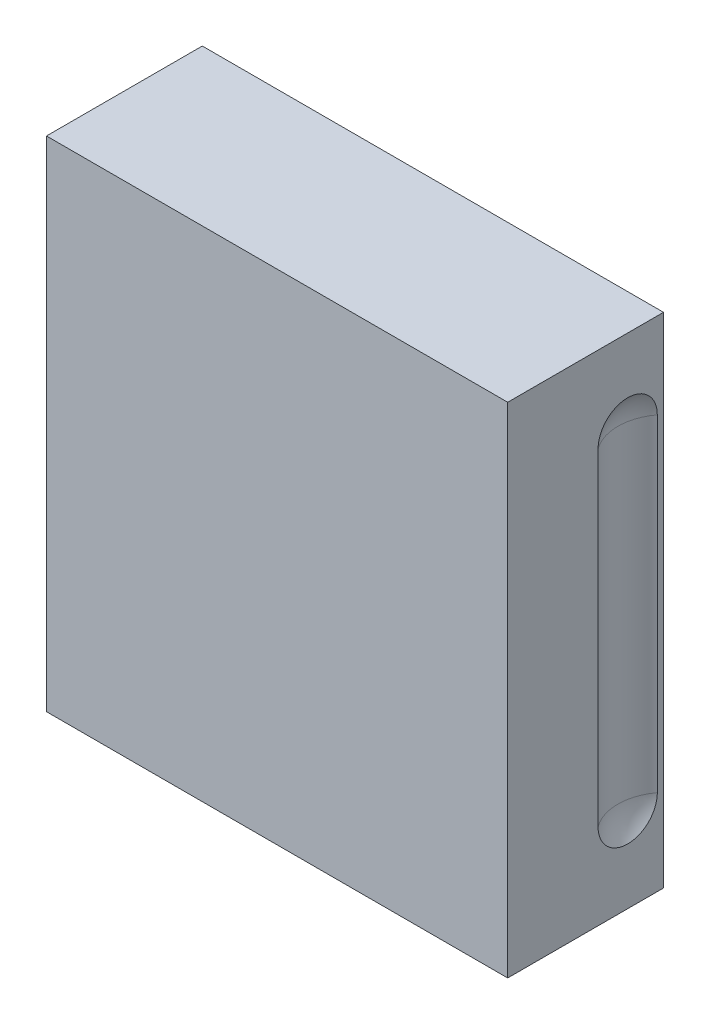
ISO-10303-21;
HEADER;
FILE_DESCRIPTION(('STEP AP214'),'2;1');
FILE_NAME('part.step','',(''),(''),'','','');
FILE_SCHEMA(('AUTOMOTIVE_DESIGN { 1 0 10303 214 1 1 1 1 }'));
ENDSEC;
DATA;
#1=APPLICATION_CONTEXT('core data for automotive mechanical design processes');
#2=APPLICATION_PROTOCOL_DEFINITION('international standard','automotive_design',2000,#1);
#3=PRODUCT_CONTEXT('',#1,'mechanical');
#4=PRODUCT('Part','Part','',(#3));
#5=PRODUCT_RELATED_PRODUCT_CATEGORY('part','',(#4));
#6=PRODUCT_DEFINITION_FORMATION('','',#4);
#7=PRODUCT_DEFINITION_CONTEXT('part definition',#1,'design');
#8=PRODUCT_DEFINITION('design','',#6,#7);
#9=PRODUCT_DEFINITION_SHAPE('','',#8);
#10=(LENGTH_UNIT() NAMED_UNIT(*) SI_UNIT(.MILLI.,.METRE.));
#11=(NAMED_UNIT(*) PLANE_ANGLE_UNIT() SI_UNIT($,.RADIAN.));
#12=(NAMED_UNIT(*) SI_UNIT($,.STERADIAN.) SOLID_ANGLE_UNIT());
#13=UNCERTAINTY_MEASURE_WITH_UNIT(LENGTH_MEASURE(1.E-05),#10,'distance_accuracy_value','');
#14=(GEOMETRIC_REPRESENTATION_CONTEXT(3) GLOBAL_UNCERTAINTY_ASSIGNED_CONTEXT((#13)) GLOBAL_UNIT_ASSIGNED_CONTEXT((#10,
#11,#12)) REPRESENTATION_CONTEXT('',''));
#15=CARTESIAN_POINT('',(0.,0.,0.));
#16=DIRECTION('',(0.,0.,1.));
#17=DIRECTION('',(1.,0.,0.));
#18=AXIS2_PLACEMENT_3D('',#15,#16,#17);
#19=CARTESIAN_POINT('',(-112.985411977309,221.299588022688,83.));
#20=DIRECTION('',(0.,0.,-1.));
#21=DIRECTION('',(-1.,0.,0.));
#22=AXIS2_PLACEMENT_3D('',#19,#20,#21);
#23=TOROIDAL_SURFACE('',#22,8.99999999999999,2.5);
#24=CARTESIAN_POINT('',(-101.500411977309,221.299588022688,83.2734501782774));
#25=CARTESIAN_POINT('',(-101.500411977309,221.246790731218,83.273455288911));
#26=CARTESIAN_POINT('',(-101.500411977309,221.193966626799,83.2701925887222));
#27=CARTESIAN_POINT('',(-101.500411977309,221.1155257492,83.2600004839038));
#28=CARTESIAN_POINT('',(-101.500411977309,221.089544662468,83.2557291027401));
#29=CARTESIAN_POINT('',(-101.500411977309,221.037960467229,83.2452152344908));
#30=CARTESIAN_POINT('',(-101.500411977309,221.01235748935,83.2389720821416));
#31=CARTESIAN_POINT('',(-101.500411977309,220.967249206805,83.2257832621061));
#32=CARTESIAN_POINT('',(-101.500411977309,220.947615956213,83.2192769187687));
#33=CARTESIAN_POINT('',(-101.500411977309,220.908988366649,83.2046080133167));
#34=CARTESIAN_POINT('',(-101.500411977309,220.889993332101,83.1964473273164));
#35=CARTESIAN_POINT('',(-101.500411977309,220.852778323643,83.1779977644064));
#36=CARTESIAN_POINT('',(-101.500411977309,220.834569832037,83.1676854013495));
#37=CARTESIAN_POINT('',(-101.500411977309,220.799917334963,83.1444367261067));
#38=CARTESIAN_POINT('',(-101.500411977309,220.783465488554,83.1315128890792));
#39=CARTESIAN_POINT('',(-101.500411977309,220.762009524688,83.1103383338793));
#40=CARTESIAN_POINT('',(-101.500411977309,220.755687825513,83.1034297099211));
#41=CARTESIAN_POINT('',(-101.500411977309,220.743956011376,83.0888561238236));
#42=CARTESIAN_POINT('',(-101.500411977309,220.738546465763,83.0811906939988));
#43=CARTESIAN_POINT('',(-101.500411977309,220.72891222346,83.0649921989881));
#44=CARTESIAN_POINT('',(-101.500411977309,220.724704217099,83.0564489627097));
#45=CARTESIAN_POINT('',(-101.500411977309,220.718000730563,83.038730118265));
#46=CARTESIAN_POINT('',(-101.500411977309,220.715498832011,83.0295570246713));
#47=CARTESIAN_POINT('',(-101.500411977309,220.712682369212,83.0118191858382));
#48=CARTESIAN_POINT('',(-101.500411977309,220.712173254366,83.0032859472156));
#49=CARTESIAN_POINT('',(-101.500411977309,220.712864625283,82.9862928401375));
#50=CARTESIAN_POINT('',(-101.500411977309,220.714065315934,82.9778329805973));
#51=CARTESIAN_POINT('',(-101.500411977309,220.719443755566,82.9554528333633));
#52=CARTESIAN_POINT('',(-101.500411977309,220.72512391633,82.9418895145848));
#53=CARTESIAN_POINT('',(-101.500411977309,220.738244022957,82.9189771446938));
#54=CARTESIAN_POINT('',(-101.500411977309,220.745174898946,82.9093104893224));
#55=CARTESIAN_POINT('',(-101.500411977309,220.760442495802,82.8911398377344));
#56=CARTESIAN_POINT('',(-101.500411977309,220.768782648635,82.882638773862));
#57=CARTESIAN_POINT('',(-101.500411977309,220.793090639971,82.860639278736));
#58=CARTESIAN_POINT('',(-101.500411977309,220.81004308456,82.8482454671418));
#59=CARTESIAN_POINT('',(-101.500411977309,220.845496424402,82.8259633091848));
#60=CARTESIAN_POINT('',(-101.500411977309,220.864000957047,82.8160810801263));
#61=CARTESIAN_POINT('',(-101.500411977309,220.902064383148,82.7982439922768));
#62=CARTESIAN_POINT('',(-101.500411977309,220.921629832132,82.790303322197));
#63=CARTESIAN_POINT('',(-101.500411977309,220.96135707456,82.7760830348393));
#64=CARTESIAN_POINT('',(-101.500411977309,220.981519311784,82.7698046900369));
#65=CARTESIAN_POINT('',(-101.500411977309,221.042678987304,82.7530655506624));
#66=CARTESIAN_POINT('',(-101.500411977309,221.084266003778,82.7447364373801));
#67=CARTESIAN_POINT('',(-101.500411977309,221.160393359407,82.7338085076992));
#68=CARTESIAN_POINT('',(-101.500411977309,221.194834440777,82.7304412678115));
#69=CARTESIAN_POINT('',(-101.500411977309,221.263909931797,82.7265736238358));
#70=CARTESIAN_POINT('',(-101.500411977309,221.298544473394,82.7260755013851));
#71=CARTESIAN_POINT('',(-101.500411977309,221.367699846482,82.7279146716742));
#72=CARTESIAN_POINT('',(-101.500411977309,221.402220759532,82.7302489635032));
#73=CARTESIAN_POINT('',(-101.500411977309,221.470911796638,82.7379061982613));
#74=CARTESIAN_POINT('',(-101.500411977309,221.505082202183,82.7432265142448));
#75=CARTESIAN_POINT('',(-101.500411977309,221.571545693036,82.7570160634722));
#76=CARTESIAN_POINT('',(-101.500411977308,221.603862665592,82.7653688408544));
#77=CARTESIAN_POINT('',(-101.50041197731,221.66721060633,82.7859159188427));
#78=CARTESIAN_POINT('',(-101.500411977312,221.698245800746,82.7980962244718));
#79=CARTESIAN_POINT('',(-101.50041197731,221.742251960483,82.8199636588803));
#80=CARTESIAN_POINT('',(-101.500411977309,221.756214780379,82.8276467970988));
#81=CARTESIAN_POINT('',(-101.500411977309,221.783230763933,82.8444560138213));
#82=CARTESIAN_POINT('',(-101.500411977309,221.796285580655,82.8535793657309));
#83=CARTESIAN_POINT('',(-101.500411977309,221.818726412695,82.8717689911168));
#84=CARTESIAN_POINT('',(-101.500411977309,221.828346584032,82.8805400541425));
#85=CARTESIAN_POINT('',(-101.500411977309,221.846135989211,82.8994148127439));
#86=CARTESIAN_POINT('',(-101.500411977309,221.854309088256,82.9095148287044));
#87=CARTESIAN_POINT('',(-101.500411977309,221.870465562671,82.9343470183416));
#88=CARTESIAN_POINT('',(-101.500411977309,221.877751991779,82.949583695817));
#89=CARTESIAN_POINT('',(-101.500411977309,221.884318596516,82.9737193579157));
#90=CARTESIAN_POINT('',(-101.500411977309,221.885775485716,82.9820332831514));
#91=CARTESIAN_POINT('',(-101.500411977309,221.887030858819,82.9987883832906));
#92=CARTESIAN_POINT('',(-101.500411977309,221.886830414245,83.0072294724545));
#93=CARTESIAN_POINT('',(-101.500411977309,221.884928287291,83.0228241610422));
#94=CARTESIAN_POINT('',(-101.500411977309,221.883423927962,83.030003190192));
#95=CARTESIAN_POINT('',(-101.500411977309,221.879313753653,83.0440462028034));
#96=CARTESIAN_POINT('',(-101.500411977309,221.876705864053,83.0509095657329));
#97=CARTESIAN_POINT('',(-101.500411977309,221.864854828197,83.076596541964));
#98=CARTESIAN_POINT('',(-101.500411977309,221.852299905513,83.0938883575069));
#99=CARTESIAN_POINT('',(-101.500411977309,221.825929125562,83.1221499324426));
#100=CARTESIAN_POINT('',(-101.500411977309,221.812649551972,83.1336903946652));
#101=CARTESIAN_POINT('',(-101.500411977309,221.784543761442,83.1547882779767));
#102=CARTESIAN_POINT('',(-101.500411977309,221.769713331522,83.1643400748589));
#103=CARTESIAN_POINT('',(-101.500411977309,221.739332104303,83.1816683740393));
#104=CARTESIAN_POINT('',(-101.500411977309,221.723793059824,83.1894661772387));
#105=CARTESIAN_POINT('',(-101.500411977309,221.692111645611,83.2037344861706));
#106=CARTESIAN_POINT('',(-101.500411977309,221.675968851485,83.2102040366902));
#107=CARTESIAN_POINT('',(-101.500411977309,221.626906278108,83.2279283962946));
#108=CARTESIAN_POINT('',(-101.500411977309,221.593375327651,83.2374868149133));
#109=CARTESIAN_POINT('',(-101.500411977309,221.516915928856,83.2550274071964));
#110=CARTESIAN_POINT('',(-101.500411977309,221.473763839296,83.2619925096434));
#111=CARTESIAN_POINT('',(-101.500411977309,221.386943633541,83.2712043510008));
#112=CARTESIAN_POINT('',(-101.500411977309,221.343275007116,83.2734459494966));
#113=CARTESIAN_POINT('',(-101.500411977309,221.299588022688,83.2734501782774));
#114=B_SPLINE_CURVE_WITH_KNOTS('',3,(#24,#25,#26,#27,#28,#29,#30,#31,#32,#33,#34,#35,#36,#37,
#38,#39,#40,#41,#42,#43,#44,#45,#46,#47,#48,#49,#50,#51,#52,#53,#54,#55,#56,#57,#58,#59,#60,#61,
#62,#63,#64,#65,#66,#67,#68,#69,#70,#71,#72,#73,#74,#75,#76,#77,#78,#79,#80,#81,#82,#83,#84,#85,
#86,#87,#88,#89,#90,#91,#92,#93,#94,#95,#96,#97,#98,#99,#100,#101,#102,#103,#104,#105,#106,#107,
#108,#109,#110,#111,#112,#113),.UNSPECIFIED.,.T.,.F.,(4,2,2,2,2,2,2,2,2,2,2,2,2,2,2,2,2,2,2,2,2,
2,2,2,2,2,2,2,2,2,2,2,2,2,2,2,2,2,2,2,2,2,2,2,4),(0.,0.15828049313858,0.237215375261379,
0.316176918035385,0.378168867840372,0.44009090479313,0.502727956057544,0.565072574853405,
0.593109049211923,0.621162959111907,0.649589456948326,0.677908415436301,0.703381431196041,
0.72885749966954,0.772301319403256,0.807831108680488,0.843448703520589,0.906101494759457,
0.968905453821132,1.03215550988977,1.0954538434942,1.22232014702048,1.32603071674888,
1.42982374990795,1.53350691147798,1.63709900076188,1.73707341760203,1.83668645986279,
1.88443333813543,1.9320908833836,1.97102529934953,2.00985409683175,2.05957979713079,
2.0847548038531,2.10991353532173,2.13182148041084,2.15377079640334,2.21659974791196,
2.26922071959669,2.3219885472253,2.37407604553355,2.42620087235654,2.53052777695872,
2.6613542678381,2.79232305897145),.UNSPECIFIED.);
#115=CARTESIAN_POINT('',(-101.500411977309,221.299588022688,83.2734501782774));
#116=VERTEX_POINT('',#115);
#117=EDGE_CURVE('E18',#116,#116,#114,.T.);
#118=ORIENTED_EDGE('',*,*,#117,.F.);
#119=EDGE_LOOP('',(#118));
#120=FACE_BOUND('',#119,.T.);
#121=ADVANCED_FACE('F14',(#120),#23,.F.);
#122=CARTESIAN_POINT('',(-112.985411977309,162.299588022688,83.));
#123=DIRECTION('',(0.,0.,-1.));
#124=DIRECTION('',(-1.,0.,0.));
#125=AXIS2_PLACEMENT_3D('',#122,#123,#124);
#126=TOROIDAL_SURFACE('',#125,8.99999999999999,2.5);
#127=CARTESIAN_POINT('',(-101.500411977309,162.299588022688,83.2734501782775));
#128=CARTESIAN_POINT('',(-101.500411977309,162.246790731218,83.2734552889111));
#129=CARTESIAN_POINT('',(-101.500411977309,162.193966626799,83.2701925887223));
#130=CARTESIAN_POINT('',(-101.500411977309,162.1155257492,83.2600004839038));
#131=CARTESIAN_POINT('',(-101.500411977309,162.089544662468,83.2557291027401));
#132=CARTESIAN_POINT('',(-101.500411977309,162.037960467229,83.2452152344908));
#133=CARTESIAN_POINT('',(-101.500411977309,162.01235748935,83.2389720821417));
#134=CARTESIAN_POINT('',(-101.500411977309,161.967249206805,83.2257832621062));
#135=CARTESIAN_POINT('',(-101.500411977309,161.947615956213,83.2192769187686));
#136=CARTESIAN_POINT('',(-101.500411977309,161.908988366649,83.2046080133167));
#137=CARTESIAN_POINT('',(-101.500411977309,161.889993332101,83.1964473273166));
#138=CARTESIAN_POINT('',(-101.500411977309,161.852778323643,83.1779977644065));
#139=CARTESIAN_POINT('',(-101.500411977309,161.834569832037,83.1676854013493));
#140=CARTESIAN_POINT('',(-101.500411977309,161.799917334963,83.1444367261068));
#141=CARTESIAN_POINT('',(-101.50041197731,161.783465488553,83.1315128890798));
#142=CARTESIAN_POINT('',(-101.500411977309,161.762009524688,83.1103383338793));
#143=CARTESIAN_POINT('',(-101.500411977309,161.755687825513,83.1034297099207));
#144=CARTESIAN_POINT('',(-101.500411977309,161.743956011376,83.0888561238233));
#145=CARTESIAN_POINT('',(-101.500411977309,161.738546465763,83.0811906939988));
#146=CARTESIAN_POINT('',(-101.500411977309,161.72891222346,83.0649921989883));
#147=CARTESIAN_POINT('',(-101.500411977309,161.724704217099,83.0564489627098));
#148=CARTESIAN_POINT('',(-101.500411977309,161.718000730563,83.038730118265));
#149=CARTESIAN_POINT('',(-101.500411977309,161.715498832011,83.0295570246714));
#150=CARTESIAN_POINT('',(-101.500411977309,161.712682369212,83.0118191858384));
#151=CARTESIAN_POINT('',(-101.500411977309,161.712173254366,83.0032859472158));
#152=CARTESIAN_POINT('',(-101.500411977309,161.712864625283,82.9862928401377));
#153=CARTESIAN_POINT('',(-101.500411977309,161.714065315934,82.9778329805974));
#154=CARTESIAN_POINT('',(-101.500411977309,161.719443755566,82.9554528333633));
#155=CARTESIAN_POINT('',(-101.500411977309,161.725123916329,82.9418895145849));
#156=CARTESIAN_POINT('',(-101.500411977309,161.738244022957,82.9189771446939));
#157=CARTESIAN_POINT('',(-101.500411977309,161.745174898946,82.9093104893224));
#158=CARTESIAN_POINT('',(-101.500411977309,161.760442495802,82.8911398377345));
#159=CARTESIAN_POINT('',(-101.500411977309,161.768782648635,82.8826387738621));
#160=CARTESIAN_POINT('',(-101.500411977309,161.793090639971,82.8606392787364));
#161=CARTESIAN_POINT('',(-101.500411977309,161.81004308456,82.8482454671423));
#162=CARTESIAN_POINT('',(-101.500411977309,161.845496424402,82.8259633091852));
#163=CARTESIAN_POINT('',(-101.500411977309,161.864000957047,82.8160810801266));
#164=CARTESIAN_POINT('',(-101.500411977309,161.902064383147,82.7982439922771));
#165=CARTESIAN_POINT('',(-101.500411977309,161.921629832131,82.7903033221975));
#166=CARTESIAN_POINT('',(-101.500411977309,161.961357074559,82.7760830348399));
#167=CARTESIAN_POINT('',(-101.500411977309,161.981519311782,82.7698046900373));
#168=CARTESIAN_POINT('',(-101.500411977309,162.042678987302,82.7530655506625));
#169=CARTESIAN_POINT('',(-101.500411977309,162.084266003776,82.7447364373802));
#170=CARTESIAN_POINT('',(-101.500411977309,162.160393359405,82.7338085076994));
#171=CARTESIAN_POINT('',(-101.500411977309,162.194834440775,82.7304412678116));
#172=CARTESIAN_POINT('',(-101.500411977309,162.263909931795,82.7265736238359));
#173=CARTESIAN_POINT('',(-101.500411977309,162.298544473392,82.7260755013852));
#174=CARTESIAN_POINT('',(-101.500411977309,162.36769984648,82.7279146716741));
#175=CARTESIAN_POINT('',(-101.500411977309,162.40222075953,82.730248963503));
#176=CARTESIAN_POINT('',(-101.500411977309,162.470911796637,82.7379061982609));
#177=CARTESIAN_POINT('',(-101.500411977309,162.505082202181,82.7432265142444));
#178=CARTESIAN_POINT('',(-101.500411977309,162.571545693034,82.7570160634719));
#179=CARTESIAN_POINT('',(-101.500411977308,162.60386266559,82.7653688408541));
#180=CARTESIAN_POINT('',(-101.50041197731,162.667210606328,82.7859159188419));
#181=CARTESIAN_POINT('',(-101.500411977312,162.698245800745,82.7980962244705));
#182=CARTESIAN_POINT('',(-101.50041197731,162.742251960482,82.8199636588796));
#183=CARTESIAN_POINT('',(-101.500411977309,162.756214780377,82.8276467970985));
#184=CARTESIAN_POINT('',(-101.500411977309,162.783230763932,82.844456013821));
#185=CARTESIAN_POINT('',(-101.500411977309,162.796285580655,82.85357936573));
#186=CARTESIAN_POINT('',(-101.500411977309,162.818726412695,82.8717689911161));
#187=CARTESIAN_POINT('',(-101.500411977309,162.828346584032,82.8805400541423));
#188=CARTESIAN_POINT('',(-101.500411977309,162.84613598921,82.8994148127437));
#189=CARTESIAN_POINT('',(-101.500411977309,162.854309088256,82.9095148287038));
#190=CARTESIAN_POINT('',(-101.500411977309,162.870465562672,82.9343470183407));
#191=CARTESIAN_POINT('',(-101.500411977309,162.87775199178,82.9495836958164));
#192=CARTESIAN_POINT('',(-101.500411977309,162.884318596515,82.9737193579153));
#193=CARTESIAN_POINT('',(-101.500411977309,162.885775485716,82.9820332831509));
#194=CARTESIAN_POINT('',(-101.500411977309,162.887030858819,82.9987883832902));
#195=CARTESIAN_POINT('',(-101.500411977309,162.886830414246,83.0072294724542));
#196=CARTESIAN_POINT('',(-101.500411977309,162.884928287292,83.0228241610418));
#197=CARTESIAN_POINT('',(-101.500411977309,162.883423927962,83.0300031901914));
#198=CARTESIAN_POINT('',(-101.500411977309,162.879313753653,83.0440462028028));
#199=CARTESIAN_POINT('',(-101.500411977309,162.876705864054,83.0509095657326));
#200=CARTESIAN_POINT('',(-101.500411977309,162.864854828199,83.0765965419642));
#201=CARTESIAN_POINT('',(-101.500411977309,162.852299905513,83.0938883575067));
#202=CARTESIAN_POINT('',(-101.500411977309,162.825929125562,83.1221499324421));
#203=CARTESIAN_POINT('',(-101.500411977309,162.812649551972,83.1336903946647));
#204=CARTESIAN_POINT('',(-101.500411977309,162.784543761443,83.1547882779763));
#205=CARTESIAN_POINT('',(-101.500411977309,162.769713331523,83.1643400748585));
#206=CARTESIAN_POINT('',(-101.500411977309,162.739332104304,83.1816683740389));
#207=CARTESIAN_POINT('',(-101.500411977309,162.723793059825,83.1894661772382));
#208=CARTESIAN_POINT('',(-101.500411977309,162.692111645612,83.20373448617));
#209=CARTESIAN_POINT('',(-101.500411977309,162.675968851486,83.2102040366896));
#210=CARTESIAN_POINT('',(-101.500411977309,162.626906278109,83.227928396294));
#211=CARTESIAN_POINT('',(-101.500411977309,162.593375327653,83.2374868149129));
#212=CARTESIAN_POINT('',(-101.500411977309,162.516915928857,83.2550274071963));
#213=CARTESIAN_POINT('',(-101.500411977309,162.473763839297,83.2619925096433));
#214=CARTESIAN_POINT('',(-101.500411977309,162.386943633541,83.2712043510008));
#215=CARTESIAN_POINT('',(-101.500411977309,162.343275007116,83.2734459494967));
#216=CARTESIAN_POINT('',(-101.500411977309,162.299588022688,83.2734501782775));
#217=B_SPLINE_CURVE_WITH_KNOTS('',3,(#127,#128,#129,#130,#131,#132,#133,#134,#135,#136,#137,
#138,#139,#140,#141,#142,#143,#144,#145,#146,#147,#148,#149,#150,#151,#152,#153,#154,#155,#156,
#157,#158,#159,#160,#161,#162,#163,#164,#165,#166,#167,#168,#169,#170,#171,#172,#173,#174,#175,
#176,#177,#178,#179,#180,#181,#182,#183,#184,#185,#186,#187,#188,#189,#190,#191,#192,#193,#194,
#195,#196,#197,#198,#199,#200,#201,#202,#203,#204,#205,#206,#207,#208,#209,#210,#211,#212,#213,
#214,#215,#216),.UNSPECIFIED.,.T.,.F.,(4,2,2,2,2,2,2,2,2,2,2,2,2,2,2,2,2,2,2,2,2,2,2,2,2,2,2,2,
2,2,2,2,2,2,2,2,2,2,2,2,2,2,2,2,4),(0.,0.158280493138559,0.237215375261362,0.316176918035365,
0.378168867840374,0.440090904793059,0.502727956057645,0.565072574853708,0.593109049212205,
0.621162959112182,0.649589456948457,0.677908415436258,0.703381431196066,0.728857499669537,
0.77230131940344,0.807831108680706,0.843448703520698,0.906101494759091,0.968905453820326,
1.03215550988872,1.0954538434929,1.22232014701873,1.3260307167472,1.42982374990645,
1.53350691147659,1.6370990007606,1.73707341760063,1.83668645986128,1.88443333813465,
1.93209088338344,1.97102529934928,2.00985409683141,2.05957979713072,2.08475480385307,
2.10991353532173,2.13182148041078,2.15377079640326,2.21659974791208,2.26922071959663,
2.32198854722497,2.37407604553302,2.42620087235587,2.53052777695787,2.66135426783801,
2.79232305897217),.UNSPECIFIED.);
#218=CARTESIAN_POINT('',(-101.500411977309,162.299588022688,83.2734501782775));
#219=VERTEX_POINT('',#218);
#220=EDGE_CURVE('E474',#219,#219,#217,.T.);
#221=ORIENTED_EDGE('',*,*,#220,.F.);
#222=EDGE_LOOP('',(#221));
#223=FACE_BOUND('',#222,.T.);
#224=ADVANCED_FACE('F438',(#223),#126,.F.);
#225=CARTESIAN_POINT('',(-136.015411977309,221.299588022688,83.));
#226=DIRECTION('',(0.,0.,-1.));
#227=DIRECTION('',(-1.,0.,0.));
#228=AXIS2_PLACEMENT_3D('',#225,#226,#227);
#229=TOROIDAL_SURFACE('',#228,9.00000000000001,2.5);
#230=CARTESIAN_POINT('',(-147.500411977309,221.299588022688,83.2734501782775));
#231=CARTESIAN_POINT('',(-147.500411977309,221.352385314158,83.2734552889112));
#232=CARTESIAN_POINT('',(-147.500411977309,221.405209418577,83.2701925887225));
#233=CARTESIAN_POINT('',(-147.500411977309,221.483650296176,83.2600004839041));
#234=CARTESIAN_POINT('',(-147.500411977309,221.509631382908,83.2557291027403));
#235=CARTESIAN_POINT('',(-147.500411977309,221.561215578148,83.2452152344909));
#236=CARTESIAN_POINT('',(-147.500411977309,221.586818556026,83.2389720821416));
#237=CARTESIAN_POINT('',(-147.500411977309,221.631926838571,83.2257832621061));
#238=CARTESIAN_POINT('',(-147.500411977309,221.651560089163,83.2192769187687));
#239=CARTESIAN_POINT('',(-147.500411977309,221.690187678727,83.2046080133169));
#240=CARTESIAN_POINT('',(-147.500411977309,221.709182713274,83.1964473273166));
#241=CARTESIAN_POINT('',(-147.500411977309,221.746397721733,83.1779977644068));
#242=CARTESIAN_POINT('',(-147.500411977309,221.764606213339,83.1676854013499));
#243=CARTESIAN_POINT('',(-147.500411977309,221.799258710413,83.1444367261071));
#244=CARTESIAN_POINT('',(-147.500411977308,221.815710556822,83.1315128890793));
#245=CARTESIAN_POINT('',(-147.500411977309,221.837166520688,83.1103383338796));
#246=CARTESIAN_POINT('',(-147.500411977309,221.843488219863,83.1034297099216));
#247=CARTESIAN_POINT('',(-147.500411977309,221.855220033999,83.088856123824));
#248=CARTESIAN_POINT('',(-147.500411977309,221.860629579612,83.081190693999));
#249=CARTESIAN_POINT('',(-147.500411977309,221.870263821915,83.0649921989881));
#250=CARTESIAN_POINT('',(-147.500411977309,221.874471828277,83.0564489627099));
#251=CARTESIAN_POINT('',(-147.500411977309,221.881175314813,83.0387301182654));
#252=CARTESIAN_POINT('',(-147.500411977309,221.883677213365,83.0295570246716));
#253=CARTESIAN_POINT('',(-147.500411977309,221.886493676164,83.0118191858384));
#254=CARTESIAN_POINT('',(-147.500411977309,221.88700279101,83.0032859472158));
#255=CARTESIAN_POINT('',(-147.500411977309,221.886311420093,82.9862928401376));
#256=CARTESIAN_POINT('',(-147.500411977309,221.885110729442,82.9778329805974));
#257=CARTESIAN_POINT('',(-147.500411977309,221.879732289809,82.9554528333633));
#258=CARTESIAN_POINT('',(-147.500411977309,221.874052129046,82.9418895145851));
#259=CARTESIAN_POINT('',(-147.500411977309,221.860932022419,82.9189771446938));
#260=CARTESIAN_POINT('',(-147.500411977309,221.85400114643,82.909310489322));
#261=CARTESIAN_POINT('',(-147.500411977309,221.838733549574,82.8911398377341));
#262=CARTESIAN_POINT('',(-147.500411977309,221.830393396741,82.882638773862));
#263=CARTESIAN_POINT('',(-147.500411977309,221.806085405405,82.8606392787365));
#264=CARTESIAN_POINT('',(-147.500411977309,221.789132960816,82.848245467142));
#265=CARTESIAN_POINT('',(-147.500411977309,221.753679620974,82.8259633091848));
#266=CARTESIAN_POINT('',(-147.500411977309,221.735175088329,82.8160810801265));
#267=CARTESIAN_POINT('',(-147.500411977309,221.697111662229,82.798243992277));
#268=CARTESIAN_POINT('',(-147.500411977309,221.677546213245,82.7903033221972));
#269=CARTESIAN_POINT('',(-147.500411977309,221.637818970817,82.7760830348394));
#270=CARTESIAN_POINT('',(-147.500411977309,221.617656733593,82.7698046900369));
#271=CARTESIAN_POINT('',(-147.500411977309,221.556497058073,82.7530655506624));
#272=CARTESIAN_POINT('',(-147.500411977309,221.514910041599,82.7447364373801));
#273=CARTESIAN_POINT('',(-147.500411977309,221.43878268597,82.7338085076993));
#274=CARTESIAN_POINT('',(-147.500411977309,221.404341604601,82.7304412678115));
#275=CARTESIAN_POINT('',(-147.500411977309,221.335266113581,82.7265736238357));
#276=CARTESIAN_POINT('',(-147.500411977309,221.300631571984,82.7260755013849));
#277=CARTESIAN_POINT('',(-147.500411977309,221.231476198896,82.7279146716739));
#278=CARTESIAN_POINT('',(-147.500411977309,221.196955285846,82.7302489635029));
#279=CARTESIAN_POINT('',(-147.500411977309,221.128264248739,82.7379061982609));
#280=CARTESIAN_POINT('',(-147.500411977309,221.094093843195,82.7432265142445));
#281=CARTESIAN_POINT('',(-147.500411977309,221.027630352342,82.7570160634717));
#282=CARTESIAN_POINT('',(-147.50041197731,220.995313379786,82.7653688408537));
#283=CARTESIAN_POINT('',(-147.500411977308,220.931965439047,82.7859159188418));
#284=CARTESIAN_POINT('',(-147.500411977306,220.900930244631,82.7980962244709));
#285=CARTESIAN_POINT('',(-147.500411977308,220.856924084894,82.8199636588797));
#286=CARTESIAN_POINT('',(-147.500411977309,220.842961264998,82.8276467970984));
#287=CARTESIAN_POINT('',(-147.500411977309,220.815945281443,82.8444560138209));
#288=CARTESIAN_POINT('',(-147.500411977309,220.802890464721,82.8535793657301));
#289=CARTESIAN_POINT('',(-147.500411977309,220.780449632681,82.8717689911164));
#290=CARTESIAN_POINT('',(-147.500411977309,220.770829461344,82.8805400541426));
#291=CARTESIAN_POINT('',(-147.500411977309,220.753040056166,82.899414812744));
#292=CARTESIAN_POINT('',(-147.500411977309,220.74486695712,82.9095148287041));
#293=CARTESIAN_POINT('',(-147.500411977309,220.728710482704,82.9343470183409));
#294=CARTESIAN_POINT('',(-147.500411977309,220.721424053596,82.9495836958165));
#295=CARTESIAN_POINT('',(-147.500411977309,220.71485744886,82.9737193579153));
#296=CARTESIAN_POINT('',(-147.500411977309,220.71340055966,82.9820332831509));
#297=CARTESIAN_POINT('',(-147.500411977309,220.712145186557,82.9987883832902));
#298=CARTESIAN_POINT('',(-147.500411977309,220.71234563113,83.0072294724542));
#299=CARTESIAN_POINT('',(-147.500411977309,220.714247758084,83.0228241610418));
#300=CARTESIAN_POINT('',(-147.500411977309,220.715752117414,83.0300031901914));
#301=CARTESIAN_POINT('',(-147.500411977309,220.719862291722,83.0440462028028));
#302=CARTESIAN_POINT('',(-147.500411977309,220.722470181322,83.0509095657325));
#303=CARTESIAN_POINT('',(-147.500411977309,220.734321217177,83.076596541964));
#304=CARTESIAN_POINT('',(-147.500411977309,220.746876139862,83.0938883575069));
#305=CARTESIAN_POINT('',(-147.500411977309,220.773246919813,83.1221499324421));
#306=CARTESIAN_POINT('',(-147.500411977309,220.786526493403,83.1336903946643));
#307=CARTESIAN_POINT('',(-147.500411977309,220.814632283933,83.1547882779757));
#308=CARTESIAN_POINT('',(-147.500411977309,220.829462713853,83.1643400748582));
#309=CARTESIAN_POINT('',(-147.500411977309,220.859843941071,83.1816683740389));
#310=CARTESIAN_POINT('',(-147.500411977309,220.87538298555,83.1894661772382));
#311=CARTESIAN_POINT('',(-147.500411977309,220.907064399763,83.20373448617));
#312=CARTESIAN_POINT('',(-147.500411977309,220.92320719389,83.2102040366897));
#313=CARTESIAN_POINT('',(-147.500411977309,220.972269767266,83.2279283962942));
#314=CARTESIAN_POINT('',(-147.500411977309,221.005800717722,83.2374868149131));
#315=CARTESIAN_POINT('',(-147.500411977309,221.082260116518,83.2550274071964));
#316=CARTESIAN_POINT('',(-147.500411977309,221.125412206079,83.2619925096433));
#317=CARTESIAN_POINT('',(-147.500411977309,221.212232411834,83.2712043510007));
#318=CARTESIAN_POINT('',(-147.500411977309,221.25590103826,83.2734459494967));
#319=CARTESIAN_POINT('',(-147.500411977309,221.299588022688,83.2734501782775));
#320=B_SPLINE_CURVE_WITH_KNOTS('',3,(#230,#231,#232,#233,#234,#235,#236,#237,#238,#239,#240,
#241,#242,#243,#244,#245,#246,#247,#248,#249,#250,#251,#252,#253,#254,#255,#256,#257,#258,#259,
#260,#261,#262,#263,#264,#265,#266,#267,#268,#269,#270,#271,#272,#273,#274,#275,#276,#277,#278,
#279,#280,#281,#282,#283,#284,#285,#286,#287,#288,#289,#290,#291,#292,#293,#294,#295,#296,#297,
#298,#299,#300,#301,#302,#303,#304,#305,#306,#307,#308,#309,#310,#311,#312,#313,#314,#315,#316,
#317,#318,#319),.UNSPECIFIED.,.T.,.F.,(4,2,2,2,2,2,2,2,2,2,2,2,2,2,2,2,2,2,2,2,2,2,2,2,2,2,2,2,
2,2,2,2,2,2,2,2,2,2,2,2,2,2,2,2,4),(0.,0.158280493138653,0.237215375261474,0.316176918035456,
0.378168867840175,0.440090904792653,0.502727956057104,0.565072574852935,0.593109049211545,
0.62116295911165,0.649589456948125,0.677908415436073,0.70338143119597,0.728857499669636,
0.772301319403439,0.80783110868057,0.843448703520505,0.906101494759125,0.968905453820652,
1.03215550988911,1.09545384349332,1.2223201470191,1.32603071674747,1.42982374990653,
1.53350691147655,1.63709900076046,1.73707341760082,1.83668645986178,1.88443333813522,
1.93209088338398,1.97102529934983,2.00985409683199,2.05957979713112,2.08475480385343,
2.10991353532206,2.13182148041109,2.1537707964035,2.21659974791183,2.26922071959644,
2.32198854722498,2.37407604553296,2.42620087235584,2.53052777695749,2.66135426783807,
2.79232305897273),.UNSPECIFIED.);
#321=CARTESIAN_POINT('',(-147.500411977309,221.299588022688,83.2734501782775));
#322=VERTEX_POINT('',#321);
#323=EDGE_CURVE('E269',#322,#322,#320,.T.);
#324=ORIENTED_EDGE('',*,*,#323,.F.);
#325=EDGE_LOOP('',(#324));
#326=FACE_BOUND('',#325,.T.);
#327=ADVANCED_FACE('F430',(#326),#229,.F.);
#328=CARTESIAN_POINT('',(-136.015411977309,162.299588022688,83.));
#329=DIRECTION('',(0.,0.,-1.));
#330=DIRECTION('',(-1.,0.,0.));
#331=AXIS2_PLACEMENT_3D('',#328,#329,#330);
#332=TOROIDAL_SURFACE('',#331,9.00000000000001,2.5);
#333=CARTESIAN_POINT('',(-147.500411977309,162.299588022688,83.2734501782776));
#334=CARTESIAN_POINT('',(-147.500411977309,162.352385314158,83.2734552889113));
#335=CARTESIAN_POINT('',(-147.500411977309,162.405209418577,83.2701925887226));
#336=CARTESIAN_POINT('',(-147.500411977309,162.483650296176,83.260000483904));
#337=CARTESIAN_POINT('',(-147.500411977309,162.509631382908,83.2557291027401));
#338=CARTESIAN_POINT('',(-147.500411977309,162.561215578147,83.2452152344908));
#339=CARTESIAN_POINT('',(-147.500411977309,162.586818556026,83.2389720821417));
#340=CARTESIAN_POINT('',(-147.500411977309,162.631926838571,83.2257832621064));
#341=CARTESIAN_POINT('',(-147.500411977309,162.651560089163,83.2192769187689));
#342=CARTESIAN_POINT('',(-147.500411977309,162.690187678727,83.2046080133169));
#343=CARTESIAN_POINT('',(-147.500411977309,162.709182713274,83.1964473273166));
#344=CARTESIAN_POINT('',(-147.500411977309,162.746397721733,83.1779977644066));
#345=CARTESIAN_POINT('',(-147.500411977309,162.764606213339,83.1676854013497));
#346=CARTESIAN_POINT('',(-147.500411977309,162.799258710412,83.1444367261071));
#347=CARTESIAN_POINT('',(-147.500411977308,162.815710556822,83.1315128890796));
#348=CARTESIAN_POINT('',(-147.500411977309,162.837166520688,83.1103383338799));
#349=CARTESIAN_POINT('',(-147.500411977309,162.843488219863,83.1034297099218));
#350=CARTESIAN_POINT('',(-147.500411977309,162.855220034,83.0888561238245));
#351=CARTESIAN_POINT('',(-147.500411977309,162.860629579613,83.0811906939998));
#352=CARTESIAN_POINT('',(-147.500411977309,162.870263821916,83.0649921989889));
#353=CARTESIAN_POINT('',(-147.500411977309,162.874471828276,83.0564489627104));
#354=CARTESIAN_POINT('',(-147.500411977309,162.881175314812,83.0387301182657));
#355=CARTESIAN_POINT('',(-147.500411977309,162.883677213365,83.0295570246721));
#356=CARTESIAN_POINT('',(-147.500411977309,162.886493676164,83.0118191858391));
#357=CARTESIAN_POINT('',(-147.500411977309,162.88700279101,83.0032859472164));
#358=CARTESIAN_POINT('',(-147.500411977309,162.886311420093,82.9862928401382));
#359=CARTESIAN_POINT('',(-147.500411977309,162.885110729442,82.977832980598));
#360=CARTESIAN_POINT('',(-147.500411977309,162.87973228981,82.9554528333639));
#361=CARTESIAN_POINT('',(-147.500411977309,162.874052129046,82.9418895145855));
#362=CARTESIAN_POINT('',(-147.500411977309,162.860932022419,82.9189771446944));
#363=CARTESIAN_POINT('',(-147.500411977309,162.85400114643,82.9093104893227));
#364=CARTESIAN_POINT('',(-147.500411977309,162.838733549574,82.8911398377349));
#365=CARTESIAN_POINT('',(-147.500411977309,162.830393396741,82.8826387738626));
#366=CARTESIAN_POINT('',(-147.500411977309,162.806085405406,82.8606392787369));
#367=CARTESIAN_POINT('',(-147.500411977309,162.789132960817,82.8482454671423));
#368=CARTESIAN_POINT('',(-147.500411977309,162.753679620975,82.8259633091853));
#369=CARTESIAN_POINT('',(-147.500411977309,162.73517508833,82.8160810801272));
#370=CARTESIAN_POINT('',(-147.500411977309,162.69711166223,82.7982439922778));
#371=CARTESIAN_POINT('',(-147.500411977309,162.677546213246,82.7903033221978));
#372=CARTESIAN_POINT('',(-147.500411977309,162.637818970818,82.7760830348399));
#373=CARTESIAN_POINT('',(-147.500411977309,162.617656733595,82.7698046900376));
#374=CARTESIAN_POINT('',(-147.500411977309,162.556497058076,82.7530655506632));
#375=CARTESIAN_POINT('',(-147.500411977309,162.514910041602,82.7447364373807));
#376=CARTESIAN_POINT('',(-147.500411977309,162.438782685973,82.7338085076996));
#377=CARTESIAN_POINT('',(-147.500411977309,162.404341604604,82.7304412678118));
#378=CARTESIAN_POINT('',(-147.500411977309,162.335266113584,82.7265736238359));
#379=CARTESIAN_POINT('',(-147.500411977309,162.300631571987,82.726075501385));
#380=CARTESIAN_POINT('',(-147.500411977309,162.231476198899,82.7279146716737));
#381=CARTESIAN_POINT('',(-147.500411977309,162.196955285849,82.7302489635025));
#382=CARTESIAN_POINT('',(-147.500411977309,162.128264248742,82.7379061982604));
#383=CARTESIAN_POINT('',(-147.500411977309,162.094093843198,82.743226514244));
#384=CARTESIAN_POINT('',(-147.500411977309,162.027630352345,82.7570160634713));
#385=CARTESIAN_POINT('',(-147.50041197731,161.995313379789,82.7653688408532));
#386=CARTESIAN_POINT('',(-147.500411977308,161.93196543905,82.7859159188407));
#387=CARTESIAN_POINT('',(-147.500411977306,161.900930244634,82.7980962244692));
#388=CARTESIAN_POINT('',(-147.500411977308,161.856924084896,82.8199636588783));
#389=CARTESIAN_POINT('',(-147.500411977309,161.842961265,82.8276467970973));
#390=CARTESIAN_POINT('',(-147.500411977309,161.815945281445,82.84445601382));
#391=CARTESIAN_POINT('',(-147.500411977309,161.802890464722,82.8535793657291));
#392=CARTESIAN_POINT('',(-147.500411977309,161.780449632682,82.8717689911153));
#393=CARTESIAN_POINT('',(-147.500411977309,161.770829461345,82.8805400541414));
#394=CARTESIAN_POINT('',(-147.500411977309,161.753040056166,82.8994148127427));
#395=CARTESIAN_POINT('',(-147.500411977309,161.74486695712,82.9095148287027));
#396=CARTESIAN_POINT('',(-147.500411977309,161.728710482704,82.9343470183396));
#397=CARTESIAN_POINT('',(-147.500411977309,161.721424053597,82.9495836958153));
#398=CARTESIAN_POINT('',(-147.500411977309,161.71485744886,82.9737193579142));
#399=CARTESIAN_POINT('',(-147.500411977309,161.71340055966,82.9820332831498));
#400=CARTESIAN_POINT('',(-147.500411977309,161.712145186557,82.9987883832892));
#401=CARTESIAN_POINT('',(-147.500411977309,161.712345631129,83.0072294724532));
#402=CARTESIAN_POINT('',(-147.500411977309,161.714247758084,83.0228241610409));
#403=CARTESIAN_POINT('',(-147.500411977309,161.715752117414,83.0300031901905));
#404=CARTESIAN_POINT('',(-147.500411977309,161.719862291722,83.044046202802));
#405=CARTESIAN_POINT('',(-147.500411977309,161.722470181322,83.0509095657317));
#406=CARTESIAN_POINT('',(-147.500411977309,161.734321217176,83.0765965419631));
#407=CARTESIAN_POINT('',(-147.500411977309,161.746876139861,83.0938883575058));
#408=CARTESIAN_POINT('',(-147.500411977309,161.773246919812,83.1221499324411));
#409=CARTESIAN_POINT('',(-147.500411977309,161.786526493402,83.1336903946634));
#410=CARTESIAN_POINT('',(-147.500411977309,161.814632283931,83.1547882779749));
#411=CARTESIAN_POINT('',(-147.500411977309,161.829462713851,83.1643400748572));
#412=CARTESIAN_POINT('',(-147.500411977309,161.859843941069,83.1816683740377));
#413=CARTESIAN_POINT('',(-147.500411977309,161.875382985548,83.189466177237));
#414=CARTESIAN_POINT('',(-147.500411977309,161.90706439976,83.2037344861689));
#415=CARTESIAN_POINT('',(-147.500411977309,161.923207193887,83.2102040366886));
#416=CARTESIAN_POINT('',(-147.500411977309,161.972269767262,83.2279283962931));
#417=CARTESIAN_POINT('',(-147.500411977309,162.005800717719,83.2374868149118));
#418=CARTESIAN_POINT('',(-147.500411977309,162.082260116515,83.2550274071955));
#419=CARTESIAN_POINT('',(-147.500411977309,162.125412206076,83.261992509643));
#420=CARTESIAN_POINT('',(-147.500411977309,162.212232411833,83.2712043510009));
#421=CARTESIAN_POINT('',(-147.500411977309,162.255901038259,83.2734459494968));
#422=CARTESIAN_POINT('',(-147.500411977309,162.299588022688,83.2734501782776));
#423=B_SPLINE_CURVE_WITH_KNOTS('',3,(#333,#334,#335,#336,#337,#338,#339,#340,#341,#342,#343,
#344,#345,#346,#347,#348,#349,#350,#351,#352,#353,#354,#355,#356,#357,#358,#359,#360,#361,#362,
#363,#364,#365,#366,#367,#368,#369,#370,#371,#372,#373,#374,#375,#376,#377,#378,#379,#380,#381,
#382,#383,#384,#385,#386,#387,#388,#389,#390,#391,#392,#393,#394,#395,#396,#397,#398,#399,#400,
#401,#402,#403,#404,#405,#406,#407,#408,#409,#410,#411,#412,#413,#414,#415,#416,#417,#418,#419,
#420,#421,#422),.UNSPECIFIED.,.T.,.F.,(4,2,2,2,2,2,2,2,2,2,2,2,2,2,2,2,2,2,2,2,2,2,2,2,2,2,2,2,
2,2,2,2,2,2,2,2,2,2,2,2,2,2,2,2,4),(0.,0.158280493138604,0.237215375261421,0.316176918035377,
0.378168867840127,0.440090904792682,0.502727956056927,0.565072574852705,0.593109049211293,
0.621162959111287,0.649589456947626,0.677908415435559,0.703381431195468,0.728857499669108,
0.772301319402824,0.807831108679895,0.843448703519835,0.906101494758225,0.968905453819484,
1.03215550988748,1.0954538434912,1.22232014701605,1.32603071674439,1.42982374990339,
1.53350691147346,1.63709900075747,1.73707341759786,1.83668645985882,1.88443333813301,
1.93209088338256,1.9710252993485,2.00985409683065,2.05957979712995,2.08475480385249,
2.10991353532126,2.13182148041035,2.15377079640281,2.21659974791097,2.26922071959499,
2.32198854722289,2.37407604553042,2.42620087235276,2.53052777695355,2.66135426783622,
2.79232305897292),.UNSPECIFIED.);
#424=CARTESIAN_POINT('',(-147.500411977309,162.299588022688,83.2734501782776));
#425=VERTEX_POINT('',#424);
#426=EDGE_CURVE('E272',#425,#425,#423,.T.);
#427=ORIENTED_EDGE('',*,*,#426,.F.);
#428=EDGE_LOOP('',(#427));
#429=FACE_BOUND('',#428,.T.);
#430=ADVANCED_FACE('F323',(#429),#332,.F.);
#431=CARTESIAN_POINT('',(-124.500411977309,191.799588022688,85.5));
#432=DIRECTION('',(0.,0.,-1.));
#433=DIRECTION('',(-1.,0.,0.));
#434=AXIS2_PLACEMENT_3D('',#431,#432,#433);
#435=PLANE('',#434);
#436=DIRECTION('',(0.,1.,0.));
#437=VECTOR('',#436,1.);
#438=CARTESIAN_POINT('',(-147.500411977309,191.799588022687,85.5));
#439=LINE('',#438,#437);
#440=CARTESIAN_POINT('',(-147.500411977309,238.799588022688,85.5));
#441=VERTEX_POINT('',#440);
#442=CARTESIAN_POINT('',(-147.500411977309,144.799588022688,85.5));
#443=VERTEX_POINT('',#442);
#444=EDGE_CURVE('E281',#441,#443,#439,.F.);
#445=ORIENTED_EDGE('',*,*,#444,.F.);
#446=DIRECTION('',(1.,0.,0.));
#447=VECTOR('',#446,1.);
#448=CARTESIAN_POINT('',(-124.500411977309,238.799588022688,85.5));
#449=LINE('',#448,#447);
#450=CARTESIAN_POINT('',(-101.500411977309,238.799588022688,85.5));
#451=VERTEX_POINT('',#450);
#452=EDGE_CURVE('E285',#451,#441,#449,.F.);
#453=ORIENTED_EDGE('',*,*,#452,.F.);
#454=DIRECTION('',(0.,1.,0.));
#455=VECTOR('',#454,1.);
#456=CARTESIAN_POINT('',(-101.500411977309,191.799588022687,85.5));
#457=LINE('',#456,#455);
#458=CARTESIAN_POINT('',(-101.500411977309,144.799588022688,85.5));
#459=VERTEX_POINT('',#458);
#460=EDGE_CURVE('E274',#459,#451,#457,.T.);
#461=ORIENTED_EDGE('',*,*,#460,.F.);
#462=DIRECTION('',(1.,0.,0.));
#463=VECTOR('',#462,1.);
#464=CARTESIAN_POINT('',(-124.500411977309,144.799588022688,85.5));
#465=LINE('',#464,#463);
#466=EDGE_CURVE('E268',#443,#459,#465,.T.);
#467=ORIENTED_EDGE('',*,*,#466,.F.);
#468=EDGE_LOOP('',(#445,#453,#461,#467));
#469=FACE_BOUND('',#468,.T.);
#470=ADVANCED_FACE('F293',(#469),#435,.T.);
#471=CARTESIAN_POINT('',(-101.500411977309,191.799588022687,77.5));
#472=DIRECTION('',(-1.,0.,0.));
#473=DIRECTION('',(0.,0.,1.));
#474=AXIS2_PLACEMENT_3D('',#471,#472,#473);
#475=PLANE('',#474);
#476=DIRECTION('',(0.,0.,-1.));
#477=VECTOR('',#476,1.);
#478=CARTESIAN_POINT('',(-101.500411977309,238.799588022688,69.6));
#479=LINE('',#478,#477);
#480=CARTESIAN_POINT('',(-101.500411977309,238.799588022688,69.5));
#481=VERTEX_POINT('',#480);
#482=EDGE_CURVE('E248',#481,#451,#479,.F.);
#483=ORIENTED_EDGE('',*,*,#482,.F.);
#484=DIRECTION('',(0.,-1.,0.));
#485=VECTOR('',#484,1.);
#486=CARTESIAN_POINT('',(-101.500411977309,191.799588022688,69.5));
#487=LINE('',#486,#485);
#488=CARTESIAN_POINT('',(-101.500411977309,144.799588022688,69.5));
#489=VERTEX_POINT('',#488);
#490=EDGE_CURVE('E226',#481,#489,#487,.T.);
#491=ORIENTED_EDGE('',*,*,#490,.T.);
#492=DIRECTION('',(0.,0.,1.));
#493=VECTOR('',#492,1.);
#494=CARTESIAN_POINT('',(-101.500411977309,144.799588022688,69.6));
#495=LINE('',#494,#493);
#496=EDGE_CURVE('E260',#459,#489,#495,.F.);
#497=ORIENTED_EDGE('',*,*,#496,.F.);
#498=ORIENTED_EDGE('',*,*,#460,.T.);
#499=EDGE_LOOP('',(#483,#491,#497,#498));
#500=FACE_BOUND('',#499,.T.);
#501=ORIENTED_EDGE('',*,*,#220,.T.);
#502=EDGE_LOOP('',(#501));
#503=FACE_BOUND('',#502,.T.);
#504=ORIENTED_EDGE('',*,*,#117,.T.);
#505=EDGE_LOOP('',(#504));
#506=FACE_BOUND('',#505,.T.);
#507=ADVANCED_FACE('F256',(#500,#503,#506),#475,.T.);
#508=CARTESIAN_POINT('',(-124.500411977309,144.799588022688,69.6));
#509=DIRECTION('',(0.,1.,0.));
#510=DIRECTION('',(0.,0.,1.));
#511=AXIS2_PLACEMENT_3D('',#508,#509,#510);
#512=PLANE('',#511);
#513=ORIENTED_EDGE('',*,*,#466,.T.);
#514=ORIENTED_EDGE('',*,*,#496,.T.);
#515=DIRECTION('',(1.,0.,0.));
#516=VECTOR('',#515,1.);
#517=CARTESIAN_POINT('',(-124.500411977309,144.799588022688,69.5));
#518=LINE('',#517,#516);
#519=CARTESIAN_POINT('',(-147.500411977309,144.799588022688,69.5));
#520=VERTEX_POINT('',#519);
#521=EDGE_CURVE('E229',#489,#520,#518,.F.);
#522=ORIENTED_EDGE('',*,*,#521,.T.);
#523=DIRECTION('',(0.,0.,-1.));
#524=VECTOR('',#523,1.);
#525=CARTESIAN_POINT('',(-147.500411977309,144.799588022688,77.5));
#526=LINE('',#525,#524);
#527=EDGE_CURVE('E279',#443,#520,#526,.T.);
#528=ORIENTED_EDGE('',*,*,#527,.F.);
#529=EDGE_LOOP('',(#513,#514,#522,#528));
#530=FACE_BOUND('',#529,.T.);
#531=ADVANCED_FACE('F265',(#530),#512,.T.);
#532=CARTESIAN_POINT('',(-147.500411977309,191.799588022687,77.5));
#533=DIRECTION('',(1.,0.,0.));
#534=DIRECTION('',(0.,0.,-1.));
#535=AXIS2_PLACEMENT_3D('',#532,#533,#534);
#536=PLANE('',#535);
#537=ORIENTED_EDGE('',*,*,#527,.T.);
#538=DIRECTION('',(0.,-1.,0.));
#539=VECTOR('',#538,1.);
#540=CARTESIAN_POINT('',(-147.500411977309,191.799588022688,69.5));
#541=LINE('',#540,#539);
#542=CARTESIAN_POINT('',(-147.500411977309,238.799588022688,69.5));
#543=VERTEX_POINT('',#542);
#544=EDGE_CURVE('E231',#520,#543,#541,.F.);
#545=ORIENTED_EDGE('',*,*,#544,.T.);
#546=DIRECTION('',(0.,0.,-1.));
#547=VECTOR('',#546,1.);
#548=CARTESIAN_POINT('',(-147.500411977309,238.799588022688,69.6));
#549=LINE('',#548,#547);
#550=EDGE_CURVE('E86',#441,#543,#549,.T.);
#551=ORIENTED_EDGE('',*,*,#550,.F.);
#552=ORIENTED_EDGE('',*,*,#444,.T.);
#553=EDGE_LOOP('',(#537,#545,#551,#552));
#554=FACE_BOUND('',#553,.T.);
#555=ORIENTED_EDGE('',*,*,#426,.T.);
#556=EDGE_LOOP('',(#555));
#557=FACE_BOUND('',#556,.T.);
#558=ORIENTED_EDGE('',*,*,#323,.T.);
#559=EDGE_LOOP('',(#558));
#560=FACE_BOUND('',#559,.T.);
#561=ADVANCED_FACE('F326',(#554,#557,#560),#536,.T.);
#562=CARTESIAN_POINT('',(-124.500411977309,238.799588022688,69.6));
#563=DIRECTION('',(0.,-1.,0.));
#564=DIRECTION('',(0.,0.,-1.));
#565=AXIS2_PLACEMENT_3D('',#562,#563,#564);
#566=PLANE('',#565);
#567=ORIENTED_EDGE('',*,*,#452,.T.);
#568=ORIENTED_EDGE('',*,*,#550,.T.);
#569=DIRECTION('',(1.,0.,0.));
#570=VECTOR('',#569,1.);
#571=CARTESIAN_POINT('',(-124.500411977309,238.799588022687,69.5));
#572=LINE('',#571,#570);
#573=EDGE_CURVE('E168',#543,#481,#572,.T.);
#574=ORIENTED_EDGE('',*,*,#573,.T.);
#575=ORIENTED_EDGE('',*,*,#482,.T.);
#576=EDGE_LOOP('',(#567,#568,#574,#575));
#577=FACE_BOUND('',#576,.T.);
#578=ADVANCED_FACE('F245',(#577),#566,.T.);
#579=CARTESIAN_POINT('',(-37.750411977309,139.299456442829,81.));
#580=DIRECTION('',(0.6379405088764,0.585892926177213,0.499761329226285));
#581=DIRECTION('',(-0.270362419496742,0.778057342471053,-0.56703697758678));
#582=AXIS2_PLACEMENT_3D('',#579,#580,#581);
#583=SPHERICAL_SURFACE('',#582,15.9);
#584=CARTESIAN_POINT('',(-37.750411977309,139.299456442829,81.));
#585=DIRECTION('',(0.,1.,0.));
#586=DIRECTION('',(0.,0.,1.));
#587=AXIS2_PLACEMENT_3D('',#584,#585,#586);
#588=CIRCLE('',#587,15.9);
#589=CARTESIAN_POINT('',(-50.500411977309,139.299456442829,71.5001315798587));
#590=VERTEX_POINT('',#589);
#591=CARTESIAN_POINT('',(-50.500411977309,139.299456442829,90.4998684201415));
#592=VERTEX_POINT('',#591);
#593=EDGE_CURVE('E80',#590,#592,#588,.T.);
#594=ORIENTED_EDGE('',*,*,#593,.T.);
#595=CARTESIAN_POINT('',(-50.500411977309,139.299456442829,90.4998684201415));
#596=CARTESIAN_POINT('',(-50.5004119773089,139.032269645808,90.4998971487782));
#597=CARTESIAN_POINT('',(-50.5004119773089,138.765086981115,90.4885975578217));
#598=CARTESIAN_POINT('',(-50.5004119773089,138.232633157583,90.443549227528));
#599=CARTESIAN_POINT('',(-50.5004119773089,137.967361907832,90.4098015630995));
#600=CARTESIAN_POINT('',(-50.5004119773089,137.44079333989,90.3200960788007));
#601=CARTESIAN_POINT('',(-50.5004119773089,137.179493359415,90.2641538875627));
#602=CARTESIAN_POINT('',(-50.5004119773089,136.662535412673,90.1304663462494));
#603=CARTESIAN_POINT('',(-50.500411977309,136.406877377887,90.0527212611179));
#604=CARTESIAN_POINT('',(-50.500411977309,135.902900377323,89.8759367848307));
#605=CARTESIAN_POINT('',(-50.5004119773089,135.654584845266,89.7768876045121));
#606=CARTESIAN_POINT('',(-50.5004119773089,135.167176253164,89.5582186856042));
#607=CARTESIAN_POINT('',(-50.5004119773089,134.928083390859,89.4385985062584));
#608=CARTESIAN_POINT('',(-50.5004119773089,134.460873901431,89.1796660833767));
#609=CARTESIAN_POINT('',(-50.5004119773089,134.232755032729,89.0403578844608));
#610=CARTESIAN_POINT('',(-50.5004119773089,133.789063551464,88.7430218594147));
#611=CARTESIAN_POINT('',(-50.500411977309,133.573490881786,88.584994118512));
#612=CARTESIAN_POINT('',(-50.500411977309,133.156415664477,88.2513359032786));
#613=CARTESIAN_POINT('',(-50.5004119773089,132.954913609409,88.0757048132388));
#614=CARTESIAN_POINT('',(-50.5004119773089,132.567424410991,87.7080969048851));
#615=CARTESIAN_POINT('',(-50.5004119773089,132.381436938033,87.5161204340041));
#616=CARTESIAN_POINT('',(-50.5004119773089,132.026265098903,87.1171505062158));
#617=CARTESIAN_POINT('',(-50.5004119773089,131.857083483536,86.9101546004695));
#618=CARTESIAN_POINT('',(-50.5004119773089,131.536760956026,86.4826454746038));
#619=CARTESIAN_POINT('',(-50.5004119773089,131.385620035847,86.2621322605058));
#620=CARTESIAN_POINT('',(-50.5004119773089,131.102459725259,85.8091663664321));
#621=CARTESIAN_POINT('',(-50.5004119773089,130.970439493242,85.5767142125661));
#622=CARTESIAN_POINT('',(-50.5004119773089,130.726451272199,85.1015141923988));
#623=CARTESIAN_POINT('',(-50.5004119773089,130.614483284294,84.8587663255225));
#624=CARTESIAN_POINT('',(-50.5004119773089,130.41140215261,84.3647166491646));
#625=CARTESIAN_POINT('',(-50.5004119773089,130.320287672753,84.1134153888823));
#626=CARTESIAN_POINT('',(-50.5004119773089,130.159552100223,83.6040306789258));
#627=CARTESIAN_POINT('',(-50.500411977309,130.089931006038,83.3459472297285));
#628=CARTESIAN_POINT('',(-50.500411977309,129.972675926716,82.8248274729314));
#629=CARTESIAN_POINT('',(-50.5004119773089,129.925042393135,82.5617910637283));
#630=CARTESIAN_POINT('',(-50.5004119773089,129.852103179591,82.0326405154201));
#631=CARTESIAN_POINT('',(-50.5004119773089,129.826797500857,81.7665263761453));
#632=CARTESIAN_POINT('',(-50.5004119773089,129.798693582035,81.2331061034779));
#633=CARTESIAN_POINT('',(-50.5004119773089,129.795895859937,80.9657999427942));
#634=CARTESIAN_POINT('',(-50.5004119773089,129.812829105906,80.4319021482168));
#635=CARTESIAN_POINT('',(-50.5004119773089,129.832560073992,80.1653105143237));
#636=CARTESIAN_POINT('',(-50.5004119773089,129.894410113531,79.634739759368));
#637=CARTESIAN_POINT('',(-50.5004119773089,129.936528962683,79.3707606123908));
#638=CARTESIAN_POINT('',(-50.5004119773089,130.042855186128,78.8472888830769));
#639=CARTESIAN_POINT('',(-50.5004119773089,130.10706256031,78.5877963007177));
#640=CARTESIAN_POINT('',(-50.5004119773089,130.257109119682,78.0751433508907));
#641=CARTESIAN_POINT('',(-50.5004119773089,130.342948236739,77.8219829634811));
#642=CARTESIAN_POINT('',(-50.5004119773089,130.535648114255,77.323793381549));
#643=CARTESIAN_POINT('',(-50.500411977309,130.642508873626,77.0787641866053));
#644=CARTESIAN_POINT('',(-50.500411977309,130.876494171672,76.5985751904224));
#645=CARTESIAN_POINT('',(-50.5004119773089,131.003619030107,76.3634155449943));
#646=CARTESIAN_POINT('',(-50.5004119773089,131.277230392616,75.9046368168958));
#647=CARTESIAN_POINT('',(-50.5004119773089,131.423717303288,75.6810179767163));
#648=CARTESIAN_POINT('',(-50.5004119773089,131.735000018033,75.246928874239));
#649=CARTESIAN_POINT('',(-50.5004119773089,131.89979474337,75.0364578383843));
#650=CARTESIAN_POINT('',(-50.5004119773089,132.24652825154,74.6301466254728));
#651=CARTESIAN_POINT('',(-50.500411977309,132.428467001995,74.434306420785));
#652=CARTESIAN_POINT('',(-50.500411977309,132.80816999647,74.0586738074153));
#653=CARTESIAN_POINT('',(-50.5004119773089,133.005932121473,73.8788792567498));
#654=CARTESIAN_POINT('',(-50.5004119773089,133.415897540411,73.5365863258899));
#655=CARTESIAN_POINT('',(-50.5004119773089,133.628100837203,73.3740879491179));
#656=CARTESIAN_POINT('',(-50.5004119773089,134.065513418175,73.0674911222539));
#657=CARTESIAN_POINT('',(-50.5004119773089,134.290727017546,72.9233988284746));
#658=CARTESIAN_POINT('',(-50.5004119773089,134.752487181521,72.6547065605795));
#659=CARTESIAN_POINT('',(-50.500411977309,134.98903340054,72.5301059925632));
#660=CARTESIAN_POINT('',(-50.500411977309,135.471936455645,72.3012049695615));
#661=CARTESIAN_POINT('',(-50.5004119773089,135.718299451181,72.1969175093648));
#662=CARTESIAN_POINT('',(-50.5004119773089,136.218935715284,72.009486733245));
#663=CARTESIAN_POINT('',(-50.5004119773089,136.473208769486,71.9263428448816));
#664=CARTESIAN_POINT('',(-50.5004119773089,136.987523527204,71.7818803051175));
#665=CARTESIAN_POINT('',(-50.5004119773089,137.247557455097,71.7205339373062));
#666=CARTESIAN_POINT('',(-50.5004119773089,137.771764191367,71.6199771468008));
#667=CARTESIAN_POINT('',(-50.5004119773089,138.035934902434,71.58075585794));
#668=CARTESIAN_POINT('',(-50.5004119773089,138.467143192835,71.5351913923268));
#669=CARTESIAN_POINT('',(-50.5004119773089,138.633490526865,71.5220355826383));
#670=CARTESIAN_POINT('',(-50.5004119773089,138.96637161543,71.5045119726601));
#671=CARTESIAN_POINT('',(-50.5004119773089,139.132904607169,71.5001296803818));
#672=CARTESIAN_POINT('',(-50.500411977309,139.299456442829,71.5001315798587));
#673=B_SPLINE_CURVE_WITH_KNOTS('',3,(#595,#596,#597,#598,#599,#600,#601,#602,#603,#604,#605,
#606,#607,#608,#609,#610,#611,#612,#613,#614,#615,#616,#617,#618,#619,#620,#621,#622,#623,#624,
#625,#626,#627,#628,#629,#630,#631,#632,#633,#634,#635,#636,#637,#638,#639,#640,#641,#642,#643,
#644,#645,#646,#647,#648,#649,#650,#651,#652,#653,#654,#655,#656,#657,#658,#659,#660,#661,#662,
#663,#664,#665,#666,#667,#668,#669,#670,#671,#672),.UNSPECIFIED.,.F.,.F.,(4,2,2,2,2,2,2,2,2,2,2,
2,2,2,2,2,2,2,2,2,2,2,2,2,2,2,2,2,2,2,2,2,2,2,2,2,2,2,4),(0.,0.801315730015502,1.60259309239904,
2.40330722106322,3.20401162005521,4.00508472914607,4.80617500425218,5.60710094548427,
6.40802324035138,7.20897355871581,8.00990685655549,8.81097103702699,9.61203486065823,
10.4130634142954,11.2140920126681,12.0150692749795,12.8160464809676,13.61704013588,
14.4180338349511,15.2190459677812,16.0200581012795,16.8210622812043,17.6220664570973,
18.4230681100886,19.2240697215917,20.0250839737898,20.8261150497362,21.6270989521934,
22.4280813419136,23.2289566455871,24.0298321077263,24.8309747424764,25.6320929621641,
26.4337220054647,27.2353293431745,28.0359137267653,28.8361045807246,29.3364921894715,
29.8360525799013),.UNSPECIFIED.);
#674=EDGE_CURVE('E78',#592,#590,#673,.T.);
#675=ORIENTED_EDGE('',*,*,#674,.T.);
#676=EDGE_LOOP('',(#594,#675));
#677=FACE_BOUND('',#676,.T.);
#678=ADVANCED_FACE('F82',(#677),#583,.F.);
#679=CARTESIAN_POINT('',(-37.750411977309,172.964380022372,81.));
#680=DIRECTION('',(0.,1.,0.));
#681=DIRECTION('',(0.,0.,1.));
#682=AXIS2_PLACEMENT_3D('',#679,#680,#681);
#683=CYLINDRICAL_SURFACE('',#682,15.9);
#684=CARTESIAN_POINT('',(-37.750411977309,244.299719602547,81.));
#685=DIRECTION('',(0.,1.,0.));
#686=DIRECTION('',(0.,0.,1.));
#687=AXIS2_PLACEMENT_3D('',#684,#685,#686);
#688=CIRCLE('',#687,15.9);
#689=CARTESIAN_POINT('',(-50.500411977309,244.299719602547,71.5001315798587));
#690=VERTEX_POINT('',#689);
#691=CARTESIAN_POINT('',(-50.5004119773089,244.299719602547,90.4998684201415));
#692=VERTEX_POINT('',#691);
#693=EDGE_CURVE('E85',#690,#692,#688,.T.);
#694=ORIENTED_EDGE('',*,*,#693,.T.);
#695=DIRECTION('',(0.,1.,0.));
#696=VECTOR('',#695,1.);
#697=CARTESIAN_POINT('',(-50.5004119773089,191.799588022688,90.4998684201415));
#698=LINE('',#697,#696);
#699=EDGE_CURVE('E89',#692,#592,#698,.F.);
#700=ORIENTED_EDGE('',*,*,#699,.T.);
#701=ORIENTED_EDGE('',*,*,#593,.F.);
#702=DIRECTION('',(0.,1.,0.));
#703=VECTOR('',#702,1.);
#704=CARTESIAN_POINT('',(-50.500411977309,191.799588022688,71.5001315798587));
#705=LINE('',#704,#703);
#706=EDGE_CURVE('E98',#590,#690,#705,.T.);
#707=ORIENTED_EDGE('',*,*,#706,.T.);
#708=EDGE_LOOP('',(#694,#700,#701,#707));
#709=FACE_BOUND('',#708,.T.);
#710=ADVANCED_FACE('F90',(#709),#683,.F.);
#711=CARTESIAN_POINT('',(-37.750411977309,244.299719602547,81.));
#712=DIRECTION('',(0.6379405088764,0.585892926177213,0.499761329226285));
#713=DIRECTION('',(-0.270362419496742,0.778057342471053,-0.56703697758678));
#714=AXIS2_PLACEMENT_3D('',#711,#712,#713);
#715=SPHERICAL_SURFACE('',#714,15.9);
#716=ORIENTED_EDGE('',*,*,#693,.F.);
#717=CARTESIAN_POINT('',(-50.500411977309,244.299719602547,71.5001315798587));
#718=CARTESIAN_POINT('',(-50.5004119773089,244.566906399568,71.5001028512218));
#719=CARTESIAN_POINT('',(-50.5004119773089,244.83408906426,71.5114024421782));
#720=CARTESIAN_POINT('',(-50.5004119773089,245.366542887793,71.556450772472));
#721=CARTESIAN_POINT('',(-50.5004119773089,245.631814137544,71.5901984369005));
#722=CARTESIAN_POINT('',(-50.5004119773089,246.158382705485,71.6799039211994));
#723=CARTESIAN_POINT('',(-50.5004119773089,246.41968268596,71.7358461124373));
#724=CARTESIAN_POINT('',(-50.5004119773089,246.936640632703,71.8695336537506));
#725=CARTESIAN_POINT('',(-50.500411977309,247.192298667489,71.9472787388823));
#726=CARTESIAN_POINT('',(-50.500411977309,247.696275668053,72.1240632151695));
#727=CARTESIAN_POINT('',(-50.5004119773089,247.944591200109,72.2231123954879));
#728=CARTESIAN_POINT('',(-50.5004119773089,248.431999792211,72.4417813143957));
#729=CARTESIAN_POINT('',(-50.5004119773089,248.671092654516,72.5614014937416));
#730=CARTESIAN_POINT('',(-50.5004119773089,249.138302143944,72.8203339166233));
#731=CARTESIAN_POINT('',(-50.5004119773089,249.366421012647,72.9596421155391));
#732=CARTESIAN_POINT('',(-50.5004119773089,249.810112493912,73.2569781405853));
#733=CARTESIAN_POINT('',(-50.500411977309,250.025685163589,73.4150058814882));
#734=CARTESIAN_POINT('',(-50.500411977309,250.442760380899,73.7486640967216));
#735=CARTESIAN_POINT('',(-50.5004119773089,250.644262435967,73.9242951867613));
#736=CARTESIAN_POINT('',(-50.5004119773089,251.031751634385,74.2919030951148));
#737=CARTESIAN_POINT('',(-50.5004119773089,251.217739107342,74.4838795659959));
#738=CARTESIAN_POINT('',(-50.5004119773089,251.572910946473,74.8828494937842));
#739=CARTESIAN_POINT('',(-50.5004119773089,251.74209256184,75.0898453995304));
#740=CARTESIAN_POINT('',(-50.5004119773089,252.06241508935,75.5173545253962));
#741=CARTESIAN_POINT('',(-50.5004119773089,252.213556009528,75.7378677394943));
#742=CARTESIAN_POINT('',(-50.5004119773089,252.496716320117,76.190833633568));
#743=CARTESIAN_POINT('',(-50.5004119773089,252.628736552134,76.423285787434));
#744=CARTESIAN_POINT('',(-50.5004119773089,252.872724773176,76.8984858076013));
#745=CARTESIAN_POINT('',(-50.5004119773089,252.984692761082,77.1412336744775));
#746=CARTESIAN_POINT('',(-50.5004119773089,253.187773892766,77.6352833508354));
#747=CARTESIAN_POINT('',(-50.5004119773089,253.278888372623,77.8865846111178));
#748=CARTESIAN_POINT('',(-50.5004119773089,253.439623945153,78.3959693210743));
#749=CARTESIAN_POINT('',(-50.5004119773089,253.509245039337,78.6540527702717));
#750=CARTESIAN_POINT('',(-50.5004119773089,253.62650011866,79.1751725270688));
#751=CARTESIAN_POINT('',(-50.5004119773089,253.67413365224,79.4382089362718));
#752=CARTESIAN_POINT('',(-50.5004119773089,253.747072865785,79.9673594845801));
#753=CARTESIAN_POINT('',(-50.5004119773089,253.772378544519,80.2334736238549));
#754=CARTESIAN_POINT('',(-50.5004119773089,253.800482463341,80.7668938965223));
#755=CARTESIAN_POINT('',(-50.5004119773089,253.803280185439,81.034200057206));
#756=CARTESIAN_POINT('',(-50.5004119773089,253.786346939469,81.5680978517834));
#757=CARTESIAN_POINT('',(-50.500411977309,253.766615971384,81.8346894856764));
#758=CARTESIAN_POINT('',(-50.500411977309,253.704765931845,82.3652602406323));
#759=CARTESIAN_POINT('',(-50.5004119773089,253.662647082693,82.6292393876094));
#760=CARTESIAN_POINT('',(-50.5004119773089,253.556320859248,83.1527111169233));
#761=CARTESIAN_POINT('',(-50.5004119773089,253.492113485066,83.4122036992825));
#762=CARTESIAN_POINT('',(-50.5004119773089,253.342066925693,83.9248566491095));
#763=CARTESIAN_POINT('',(-50.5004119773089,253.256227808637,84.1780170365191));
#764=CARTESIAN_POINT('',(-50.5004119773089,253.063527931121,84.6762066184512));
#765=CARTESIAN_POINT('',(-50.500411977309,252.95666717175,84.9212358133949));
#766=CARTESIAN_POINT('',(-50.500411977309,252.722681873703,85.4014248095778));
#767=CARTESIAN_POINT('',(-50.5004119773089,252.595557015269,85.6365844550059));
#768=CARTESIAN_POINT('',(-50.5004119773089,252.32194565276,86.0953631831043));
#769=CARTESIAN_POINT('',(-50.5004119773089,252.175458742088,86.3189820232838));
#770=CARTESIAN_POINT('',(-50.5004119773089,251.864176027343,86.7530711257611));
#771=CARTESIAN_POINT('',(-50.5004119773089,251.699381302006,86.9635421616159));
#772=CARTESIAN_POINT('',(-50.5004119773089,251.352647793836,87.3698533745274));
#773=CARTESIAN_POINT('',(-50.5004119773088,251.170709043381,87.5656935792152));
#774=CARTESIAN_POINT('',(-50.5004119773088,250.791006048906,87.9413261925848));
#775=CARTESIAN_POINT('',(-50.5004119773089,250.593243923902,88.1211207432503));
#776=CARTESIAN_POINT('',(-50.5004119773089,250.183278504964,88.4634136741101));
#777=CARTESIAN_POINT('',(-50.5004119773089,249.971075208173,88.6259120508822));
#778=CARTESIAN_POINT('',(-50.5004119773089,249.5336626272,88.9325088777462));
#779=CARTESIAN_POINT('',(-50.5004119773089,249.308449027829,89.0766011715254));
#780=CARTESIAN_POINT('',(-50.5004119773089,248.846688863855,89.3452934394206));
#781=CARTESIAN_POINT('',(-50.5004119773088,248.610142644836,89.4698940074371));
#782=CARTESIAN_POINT('',(-50.5004119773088,248.127239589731,89.6987950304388));
#783=CARTESIAN_POINT('',(-50.5004119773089,247.880876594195,89.8030824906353));
#784=CARTESIAN_POINT('',(-50.5004119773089,247.380240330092,89.990513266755));
#785=CARTESIAN_POINT('',(-50.5004119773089,247.12596727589,90.0736571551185));
#786=CARTESIAN_POINT('',(-50.5004119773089,246.611652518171,90.2181196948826));
#787=CARTESIAN_POINT('',(-50.5004119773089,246.351618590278,90.2794660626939));
#788=CARTESIAN_POINT('',(-50.5004119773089,245.827411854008,90.3800228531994));
#789=CARTESIAN_POINT('',(-50.5004119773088,245.563241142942,90.4192441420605));
#790=CARTESIAN_POINT('',(-50.5004119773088,245.132032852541,90.4648086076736));
#791=CARTESIAN_POINT('',(-50.5004119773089,244.965685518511,90.4779644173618));
#792=CARTESIAN_POINT('',(-50.5004119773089,244.632804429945,90.4954880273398));
#793=CARTESIAN_POINT('',(-50.500411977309,244.466271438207,90.4998703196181));
#794=CARTESIAN_POINT('',(-50.5004119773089,244.299719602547,90.4998684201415));
#795=B_SPLINE_CURVE_WITH_KNOTS('',3,(#717,#718,#719,#720,#721,#722,#723,#724,#725,#726,#727,
#728,#729,#730,#731,#732,#733,#734,#735,#736,#737,#738,#739,#740,#741,#742,#743,#744,#745,#746,
#747,#748,#749,#750,#751,#752,#753,#754,#755,#756,#757,#758,#759,#760,#761,#762,#763,#764,#765,
#766,#767,#768,#769,#770,#771,#772,#773,#774,#775,#776,#777,#778,#779,#780,#781,#782,#783,#784,
#785,#786,#787,#788,#789,#790,#791,#792,#793,#794),.UNSPECIFIED.,.F.,.F.,(4,2,2,2,2,2,2,2,2,2,2,
2,2,2,2,2,2,2,2,2,2,2,2,2,2,2,2,2,2,2,2,2,2,2,2,2,2,2,4),(0.,0.801315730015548,1.60259309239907,
2.40330722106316,3.20401162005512,4.00508472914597,4.80617500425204,5.6071009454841,
6.4080232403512,7.20897355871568,8.00990685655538,8.81097103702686,9.61203486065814,
10.4130634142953,11.214092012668,12.0150692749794,12.8160464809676,13.6170401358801,
14.4180338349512,15.2190459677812,16.0200581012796,16.8210622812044,17.6220664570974,
18.4230681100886,19.2240697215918,20.0250839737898,20.8261150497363,21.6270989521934,
22.4280813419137,23.2289566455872,24.0298321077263,24.8309747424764,25.6320929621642,
26.4337220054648,27.2353293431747,28.0359137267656,28.8361045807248,29.3364921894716,
29.8360525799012),.UNSPECIFIED.);
#796=EDGE_CURVE('E100',#690,#692,#795,.T.);
#797=ORIENTED_EDGE('',*,*,#796,.T.);
#798=EDGE_LOOP('',(#716,#797));
#799=FACE_BOUND('',#798,.T.);
#800=ADVANCED_FACE('F159',(#799),#715,.F.);
#801=CARTESIAN_POINT('',(-211.250411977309,139.299456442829,81.));
#802=DIRECTION('',(0.6379405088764,0.585892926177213,0.499761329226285));
#803=DIRECTION('',(-0.270362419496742,0.778057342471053,-0.56703697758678));
#804=AXIS2_PLACEMENT_3D('',#801,#802,#803);
#805=SPHERICAL_SURFACE('',#804,15.9);
#806=CARTESIAN_POINT('',(-211.250411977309,139.299456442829,81.));
#807=DIRECTION('',(0.,-1.,0.));
#808=DIRECTION('',(0.,0.,-1.));
#809=AXIS2_PLACEMENT_3D('',#806,#807,#808);
#810=CIRCLE('',#809,15.9);
#811=CARTESIAN_POINT('',(-198.500411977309,139.299456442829,90.4998684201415));
#812=VERTEX_POINT('',#811);
#813=CARTESIAN_POINT('',(-198.500411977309,139.299456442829,71.5001315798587));
#814=VERTEX_POINT('',#813);
#815=EDGE_CURVE('E310',#812,#814,#810,.F.);
#816=ORIENTED_EDGE('',*,*,#815,.T.);
#817=CARTESIAN_POINT('',(-198.500411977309,139.299456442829,71.5001315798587));
#818=CARTESIAN_POINT('',(-198.500411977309,139.032269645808,71.5001028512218));
#819=CARTESIAN_POINT('',(-198.500411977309,138.765086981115,71.5114024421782));
#820=CARTESIAN_POINT('',(-198.500411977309,138.232633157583,71.5564507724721));
#821=CARTESIAN_POINT('',(-198.500411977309,137.967361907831,71.5901984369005));
#822=CARTESIAN_POINT('',(-198.500411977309,137.44079333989,71.6799039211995));
#823=CARTESIAN_POINT('',(-198.500411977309,137.179493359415,71.7358461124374));
#824=CARTESIAN_POINT('',(-198.500411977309,136.662535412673,71.8695336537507));
#825=CARTESIAN_POINT('',(-198.500411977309,136.406877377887,71.9472787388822));
#826=CARTESIAN_POINT('',(-198.500411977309,135.902900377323,72.1240632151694));
#827=CARTESIAN_POINT('',(-198.500411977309,135.654584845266,72.2231123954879));
#828=CARTESIAN_POINT('',(-198.500411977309,135.167176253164,72.4417813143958));
#829=CARTESIAN_POINT('',(-198.500411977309,134.928083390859,72.5614014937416));
#830=CARTESIAN_POINT('',(-198.500411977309,134.460873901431,72.8203339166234));
#831=CARTESIAN_POINT('',(-198.500411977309,134.232755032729,72.9596421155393));
#832=CARTESIAN_POINT('',(-198.500411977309,133.789063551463,73.2569781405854));
#833=CARTESIAN_POINT('',(-198.500411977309,133.573490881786,73.4150058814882));
#834=CARTESIAN_POINT('',(-198.500411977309,133.156415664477,73.7486640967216));
#835=CARTESIAN_POINT('',(-198.500411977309,132.954913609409,73.9242951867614));
#836=CARTESIAN_POINT('',(-198.500411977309,132.567424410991,74.291903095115));
#837=CARTESIAN_POINT('',(-198.500411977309,132.381436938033,74.483879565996));
#838=CARTESIAN_POINT('',(-198.500411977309,132.026265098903,74.8828494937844));
#839=CARTESIAN_POINT('',(-198.500411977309,131.857083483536,75.0898453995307));
#840=CARTESIAN_POINT('',(-198.500411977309,131.536760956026,75.5173545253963));
#841=CARTESIAN_POINT('',(-198.500411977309,131.385620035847,75.7378677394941));
#842=CARTESIAN_POINT('',(-198.500411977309,131.102459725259,76.1908336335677));
#843=CARTESIAN_POINT('',(-198.500411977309,130.970439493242,76.4232857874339));
#844=CARTESIAN_POINT('',(-198.500411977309,130.726451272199,76.8984858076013));
#845=CARTESIAN_POINT('',(-198.500411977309,130.614483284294,77.1412336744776));
#846=CARTESIAN_POINT('',(-198.500411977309,130.41140215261,77.6352833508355));
#847=CARTESIAN_POINT('',(-198.500411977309,130.320287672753,77.8865846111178));
#848=CARTESIAN_POINT('',(-198.500411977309,130.159552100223,78.3959693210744));
#849=CARTESIAN_POINT('',(-198.500411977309,130.089931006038,78.6540527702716));
#850=CARTESIAN_POINT('',(-198.500411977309,129.972675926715,79.1751725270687));
#851=CARTESIAN_POINT('',(-198.500411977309,129.925042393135,79.4382089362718));
#852=CARTESIAN_POINT('',(-198.500411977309,129.852103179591,79.9673594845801));
#853=CARTESIAN_POINT('',(-198.500411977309,129.826797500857,80.2334736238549));
#854=CARTESIAN_POINT('',(-198.500411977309,129.798693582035,80.7668938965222));
#855=CARTESIAN_POINT('',(-198.500411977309,129.795895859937,81.034200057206));
#856=CARTESIAN_POINT('',(-198.500411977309,129.812829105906,81.5680978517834));
#857=CARTESIAN_POINT('',(-198.500411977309,129.832560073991,81.8346894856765));
#858=CARTESIAN_POINT('',(-198.500411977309,129.894410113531,82.3652602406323));
#859=CARTESIAN_POINT('',(-198.500411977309,129.936528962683,82.6292393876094));
#860=CARTESIAN_POINT('',(-198.500411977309,130.042855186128,83.1527111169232));
#861=CARTESIAN_POINT('',(-198.500411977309,130.10706256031,83.4122036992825));
#862=CARTESIAN_POINT('',(-198.500411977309,130.257109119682,83.9248566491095));
#863=CARTESIAN_POINT('',(-198.500411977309,130.342948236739,84.1780170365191));
#864=CARTESIAN_POINT('',(-198.500411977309,130.535648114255,84.6762066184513));
#865=CARTESIAN_POINT('',(-198.500411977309,130.642508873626,84.921235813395));
#866=CARTESIAN_POINT('',(-198.500411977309,130.876494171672,85.4014248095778));
#867=CARTESIAN_POINT('',(-198.500411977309,131.003619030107,85.636584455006));
#868=CARTESIAN_POINT('',(-198.500411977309,131.277230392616,86.0953631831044));
#869=CARTESIAN_POINT('',(-198.500411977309,131.423717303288,86.3189820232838));
#870=CARTESIAN_POINT('',(-198.500411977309,131.735000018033,86.7530711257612));
#871=CARTESIAN_POINT('',(-198.500411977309,131.89979474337,86.9635421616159));
#872=CARTESIAN_POINT('',(-198.500411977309,132.24652825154,87.3698533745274));
#873=CARTESIAN_POINT('',(-198.500411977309,132.428467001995,87.5656935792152));
#874=CARTESIAN_POINT('',(-198.500411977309,132.80816999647,87.9413261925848));
#875=CARTESIAN_POINT('',(-198.500411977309,133.005932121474,88.1211207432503));
#876=CARTESIAN_POINT('',(-198.500411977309,133.415897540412,88.4634136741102));
#877=CARTESIAN_POINT('',(-198.500411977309,133.628100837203,88.6259120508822));
#878=CARTESIAN_POINT('',(-198.500411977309,134.065513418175,88.9325088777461));
#879=CARTESIAN_POINT('',(-198.500411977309,134.290727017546,89.0766011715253));
#880=CARTESIAN_POINT('',(-198.500411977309,134.752487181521,89.3452934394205));
#881=CARTESIAN_POINT('',(-198.500411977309,134.98903340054,89.469894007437));
#882=CARTESIAN_POINT('',(-198.500411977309,135.471936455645,89.6987950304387));
#883=CARTESIAN_POINT('',(-198.500411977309,135.718299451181,89.8030824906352));
#884=CARTESIAN_POINT('',(-198.500411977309,136.218935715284,89.9905132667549));
#885=CARTESIAN_POINT('',(-198.500411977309,136.473208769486,90.0736571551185));
#886=CARTESIAN_POINT('',(-198.500411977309,136.987523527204,90.2181196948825));
#887=CARTESIAN_POINT('',(-198.500411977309,137.247557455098,90.2794660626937));
#888=CARTESIAN_POINT('',(-198.500411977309,137.771764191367,90.3800228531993));
#889=CARTESIAN_POINT('',(-198.500411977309,138.035934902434,90.4192441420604));
#890=CARTESIAN_POINT('',(-198.500411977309,138.467143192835,90.4648086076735));
#891=CARTESIAN_POINT('',(-198.500411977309,138.633490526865,90.4779644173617));
#892=CARTESIAN_POINT('',(-198.500411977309,138.96637161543,90.4954880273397));
#893=CARTESIAN_POINT('',(-198.500411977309,139.132904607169,90.499870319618));
#894=CARTESIAN_POINT('',(-198.500411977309,139.299456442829,90.4998684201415));
#895=B_SPLINE_CURVE_WITH_KNOTS('',3,(#817,#818,#819,#820,#821,#822,#823,#824,#825,#826,#827,
#828,#829,#830,#831,#832,#833,#834,#835,#836,#837,#838,#839,#840,#841,#842,#843,#844,#845,#846,
#847,#848,#849,#850,#851,#852,#853,#854,#855,#856,#857,#858,#859,#860,#861,#862,#863,#864,#865,
#866,#867,#868,#869,#870,#871,#872,#873,#874,#875,#876,#877,#878,#879,#880,#881,#882,#883,#884,
#885,#886,#887,#888,#889,#890,#891,#892,#893,#894),.UNSPECIFIED.,.F.,.F.,(4,2,2,2,2,2,2,2,2,2,2,
2,2,2,2,2,2,2,2,2,2,2,2,2,2,2,2,2,2,2,2,2,2,2,2,2,2,2,4),(0.,0.801315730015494,1.60259309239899,
2.40330722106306,3.204011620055,4.00508472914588,4.806175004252,5.60710094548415,
6.40802324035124,7.20897355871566,8.00990685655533,8.81097103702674,9.61203486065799,
10.4130634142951,11.2140920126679,12.0150692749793,12.8160464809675,13.6170401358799,
14.418033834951,15.2190459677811,16.0200581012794,16.8210622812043,17.6220664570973,
18.4230681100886,19.2240697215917,20.0250839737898,20.8261150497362,21.6270989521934,
22.4280813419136,23.2289566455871,24.0298321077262,24.8309747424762,25.6320929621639,
26.4337220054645,27.2353293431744,28.0359137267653,28.8361045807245,29.3364921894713,
29.836052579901),.UNSPECIFIED.);
#896=EDGE_CURVE('E145',#814,#812,#895,.T.);
#897=ORIENTED_EDGE('',*,*,#896,.T.);
#898=EDGE_LOOP('',(#816,#897));
#899=FACE_BOUND('',#898,.T.);
#900=ADVANCED_FACE('F153',(#899),#805,.F.);
#901=CARTESIAN_POINT('',(-211.250411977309,172.964380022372,81.));
#902=DIRECTION('',(0.,-1.,0.));
#903=DIRECTION('',(0.,0.,-1.));
#904=AXIS2_PLACEMENT_3D('',#901,#902,#903);
#905=CYLINDRICAL_SURFACE('',#904,15.9);
#906=ORIENTED_EDGE('',*,*,#815,.F.);
#907=DIRECTION('',(0.,1.,0.));
#908=VECTOR('',#907,1.);
#909=CARTESIAN_POINT('',(-198.500411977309,191.799588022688,90.4998684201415));
#910=LINE('',#909,#908);
#911=CARTESIAN_POINT('',(-198.500411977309,244.299719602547,90.4998684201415));
#912=VERTEX_POINT('',#911);
#913=EDGE_CURVE('E151',#812,#912,#910,.T.);
#914=ORIENTED_EDGE('',*,*,#913,.T.);
#915=CARTESIAN_POINT('',(-211.250411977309,244.299719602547,81.));
#916=DIRECTION('',(0.,-1.,0.));
#917=DIRECTION('',(0.,0.,-1.));
#918=AXIS2_PLACEMENT_3D('',#915,#916,#917);
#919=CIRCLE('',#918,15.9);
#920=CARTESIAN_POINT('',(-198.500411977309,244.299719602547,71.5001315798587));
#921=VERTEX_POINT('',#920);
#922=EDGE_CURVE('E116',#912,#921,#919,.F.);
#923=ORIENTED_EDGE('',*,*,#922,.T.);
#924=DIRECTION('',(0.,1.,0.));
#925=VECTOR('',#924,1.);
#926=CARTESIAN_POINT('',(-198.500411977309,191.799588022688,71.5001315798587));
#927=LINE('',#926,#925);
#928=EDGE_CURVE('E152',#921,#814,#927,.F.);
#929=ORIENTED_EDGE('',*,*,#928,.T.);
#930=EDGE_LOOP('',(#906,#914,#923,#929));
#931=FACE_BOUND('',#930,.T.);
#932=ADVANCED_FACE('F158',(#931),#905,.F.);
#933=CARTESIAN_POINT('',(-211.250411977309,244.299719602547,81.));
#934=DIRECTION('',(0.6379405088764,0.585892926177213,0.499761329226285));
#935=DIRECTION('',(-0.270362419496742,0.778057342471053,-0.56703697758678));
#936=AXIS2_PLACEMENT_3D('',#933,#934,#935);
#937=SPHERICAL_SURFACE('',#936,15.9);
#938=ORIENTED_EDGE('',*,*,#922,.F.);
#939=CARTESIAN_POINT('',(-198.500411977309,244.299719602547,90.4998684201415));
#940=CARTESIAN_POINT('',(-198.500411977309,244.566906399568,90.4998971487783));
#941=CARTESIAN_POINT('',(-198.500411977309,244.83408906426,90.4885975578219));
#942=CARTESIAN_POINT('',(-198.500411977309,245.366542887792,90.443549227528));
#943=CARTESIAN_POINT('',(-198.500411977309,245.631814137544,90.4098015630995));
#944=CARTESIAN_POINT('',(-198.500411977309,246.158382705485,90.3200960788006));
#945=CARTESIAN_POINT('',(-198.500411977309,246.41968268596,90.2641538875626));
#946=CARTESIAN_POINT('',(-198.500411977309,246.936640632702,90.1304663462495));
#947=CARTESIAN_POINT('',(-198.500411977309,247.192298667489,90.052721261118));
#948=CARTESIAN_POINT('',(-198.500411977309,247.696275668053,89.8759367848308));
#949=CARTESIAN_POINT('',(-198.500411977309,247.944591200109,89.7768876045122));
#950=CARTESIAN_POINT('',(-198.500411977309,248.431999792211,89.5582186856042));
#951=CARTESIAN_POINT('',(-198.500411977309,248.671092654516,89.4385985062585));
#952=CARTESIAN_POINT('',(-198.500411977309,249.138302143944,89.1796660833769));
#953=CARTESIAN_POINT('',(-198.500411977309,249.366421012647,89.040357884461));
#954=CARTESIAN_POINT('',(-198.500411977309,249.810112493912,88.7430218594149));
#955=CARTESIAN_POINT('',(-198.500411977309,250.025685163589,88.5849941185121));
#956=CARTESIAN_POINT('',(-198.500411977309,250.442760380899,88.2513359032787));
#957=CARTESIAN_POINT('',(-198.500411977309,250.644262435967,88.0757048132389));
#958=CARTESIAN_POINT('',(-198.500411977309,251.031751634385,87.7080969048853));
#959=CARTESIAN_POINT('',(-198.500411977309,251.217739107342,87.5161204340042));
#960=CARTESIAN_POINT('',(-198.500411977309,251.572910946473,87.1171505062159));
#961=CARTESIAN_POINT('',(-198.500411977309,251.74209256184,86.9101546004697));
#962=CARTESIAN_POINT('',(-198.500411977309,252.062415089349,86.4826454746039));
#963=CARTESIAN_POINT('',(-198.500411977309,252.213556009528,86.2621322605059));
#964=CARTESIAN_POINT('',(-198.500411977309,252.496716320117,85.8091663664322));
#965=CARTESIAN_POINT('',(-198.500411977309,252.628736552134,85.5767142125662));
#966=CARTESIAN_POINT('',(-198.500411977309,252.872724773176,85.1015141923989));
#967=CARTESIAN_POINT('',(-198.500411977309,252.984692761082,84.8587663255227));
#968=CARTESIAN_POINT('',(-198.500411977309,253.187773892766,84.3647166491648));
#969=CARTESIAN_POINT('',(-198.500411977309,253.278888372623,84.1134153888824));
#970=CARTESIAN_POINT('',(-198.500411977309,253.439623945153,83.6040306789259));
#971=CARTESIAN_POINT('',(-198.500411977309,253.509245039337,83.3459472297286));
#972=CARTESIAN_POINT('',(-198.500411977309,253.62650011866,82.8248274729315));
#973=CARTESIAN_POINT('',(-198.500411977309,253.67413365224,82.5617910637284));
#974=CARTESIAN_POINT('',(-198.500411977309,253.747072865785,82.0326405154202));
#975=CARTESIAN_POINT('',(-198.500411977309,253.772378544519,81.7665263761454));
#976=CARTESIAN_POINT('',(-198.500411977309,253.800482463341,81.233106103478));
#977=CARTESIAN_POINT('',(-198.500411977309,253.803280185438,80.9657999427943));
#978=CARTESIAN_POINT('',(-198.500411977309,253.786346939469,80.4319021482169));
#979=CARTESIAN_POINT('',(-198.500411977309,253.766615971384,80.1653105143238));
#980=CARTESIAN_POINT('',(-198.500411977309,253.704765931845,79.634739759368));
#981=CARTESIAN_POINT('',(-198.500411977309,253.662647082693,79.3707606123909));
#982=CARTESIAN_POINT('',(-198.500411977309,253.556320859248,78.847288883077));
#983=CARTESIAN_POINT('',(-198.500411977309,253.492113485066,78.5877963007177));
#984=CARTESIAN_POINT('',(-198.500411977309,253.342066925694,78.0751433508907));
#985=CARTESIAN_POINT('',(-198.500411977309,253.256227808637,77.8219829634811));
#986=CARTESIAN_POINT('',(-198.500411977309,253.063527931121,77.3237933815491));
#987=CARTESIAN_POINT('',(-198.500411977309,252.95666717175,77.0787641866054));
#988=CARTESIAN_POINT('',(-198.500411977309,252.722681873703,76.5985751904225));
#989=CARTESIAN_POINT('',(-198.500411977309,252.595557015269,76.3634155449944));
#990=CARTESIAN_POINT('',(-198.500411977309,252.32194565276,75.9046368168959));
#991=CARTESIAN_POINT('',(-198.500411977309,252.175458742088,75.6810179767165));
#992=CARTESIAN_POINT('',(-198.500411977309,251.864176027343,75.2469288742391));
#993=CARTESIAN_POINT('',(-198.500411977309,251.699381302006,75.0364578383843));
#994=CARTESIAN_POINT('',(-198.500411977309,251.352647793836,74.6301466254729));
#995=CARTESIAN_POINT('',(-198.500411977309,251.170709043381,74.4343064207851));
#996=CARTESIAN_POINT('',(-198.500411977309,250.791006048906,74.0586738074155));
#997=CARTESIAN_POINT('',(-198.500411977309,250.593243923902,73.8788792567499));
#998=CARTESIAN_POINT('',(-198.500411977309,250.183278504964,73.5365863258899));
#999=CARTESIAN_POINT('',(-198.500411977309,249.971075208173,73.3740879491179));
#1000=CARTESIAN_POINT('',(-198.500411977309,249.533662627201,73.067491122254));
#1001=CARTESIAN_POINT('',(-198.500411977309,249.30844902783,72.9233988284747));
#1002=CARTESIAN_POINT('',(-198.500411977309,248.846688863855,72.6547065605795));
#1003=CARTESIAN_POINT('',(-198.500411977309,248.610142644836,72.5301059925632));
#1004=CARTESIAN_POINT('',(-198.500411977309,248.127239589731,72.3012049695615));
#1005=CARTESIAN_POINT('',(-198.500411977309,247.880876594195,72.1969175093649));
#1006=CARTESIAN_POINT('',(-198.500411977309,247.380240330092,72.0094867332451));
#1007=CARTESIAN_POINT('',(-198.500411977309,247.12596727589,71.9263428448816));
#1008=CARTESIAN_POINT('',(-198.500411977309,246.611652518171,71.7818803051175));
#1009=CARTESIAN_POINT('',(-198.500411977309,246.351618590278,71.7205339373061));
#1010=CARTESIAN_POINT('',(-198.500411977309,245.827411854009,71.6199771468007));
#1011=CARTESIAN_POINT('',(-198.500411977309,245.563241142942,71.5807558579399));
#1012=CARTESIAN_POINT('',(-198.500411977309,245.132032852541,71.5351913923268));
#1013=CARTESIAN_POINT('',(-198.500411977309,244.965685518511,71.5220355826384));
#1014=CARTESIAN_POINT('',(-198.500411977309,244.632804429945,71.5045119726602));
#1015=CARTESIAN_POINT('',(-198.500411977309,244.466271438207,71.5001296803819));
#1016=CARTESIAN_POINT('',(-198.500411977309,244.299719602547,71.5001315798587));
#1017=B_SPLINE_CURVE_WITH_KNOTS('',3,(#939,#940,#941,#942,#943,#944,#945,#946,#947,#948,#949,
#950,#951,#952,#953,#954,#955,#956,#957,#958,#959,#960,#961,#962,#963,#964,#965,#966,#967,#968,
#969,#970,#971,#972,#973,#974,#975,#976,#977,#978,#979,#980,#981,#982,#983,#984,#985,#986,#987,
#988,#989,#990,#991,#992,#993,#994,#995,#996,#997,#998,#999,#1000,#1001,#1002,#1003,#1004,#1005,
#1006,#1007,#1008,#1009,#1010,#1011,#1012,#1013,#1014,#1015,#1016),.UNSPECIFIED.,.F.,.F.,(4,2,2,
2,2,2,2,2,2,2,2,2,2,2,2,2,2,2,2,2,2,2,2,2,2,2,2,2,2,2,2,2,2,2,2,2,2,2,4),(0.,0.801315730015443,
1.60259309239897,2.40330722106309,3.20401162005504,4.00508472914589,4.80617500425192,
5.60710094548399,6.40802324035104,7.20897355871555,8.00990685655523,8.81097103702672,
9.61203486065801,10.4130634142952,11.2140920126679,12.0150692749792,12.8160464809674,
13.6170401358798,14.4180338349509,15.219045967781,16.0200581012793,16.8210622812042,
17.6220664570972,18.4230681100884,19.2240697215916,20.0250839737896,20.826115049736,
21.6270989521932,22.4280813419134,23.228956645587,24.0298321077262,24.8309747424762,
25.632092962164,26.4337220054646,27.2353293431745,28.0359137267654,28.8361045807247,
29.3364921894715,29.8360525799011),.UNSPECIFIED.);
#1018=EDGE_CURVE('E138',#912,#921,#1017,.T.);
#1019=ORIENTED_EDGE('',*,*,#1018,.T.);
#1020=EDGE_LOOP('',(#938,#1019));
#1021=FACE_BOUND('',#1020,.T.);
#1022=ADVANCED_FACE('F170',(#1021),#937,.F.);
#1023=CARTESIAN_POINT('',(-124.500411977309,191.799588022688,69.5));
#1024=DIRECTION('',(0.,0.,1.));
#1025=DIRECTION('',(0.,-1.,0.));
#1026=AXIS2_PLACEMENT_3D('',#1023,#1024,#1025);
#1027=PLANE('',#1026);
#1028=DIRECTION('',(0.,1.,0.));
#1029=VECTOR('',#1028,1.);
#1030=CARTESIAN_POINT('',(-198.500411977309,191.799588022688,69.5));
#1031=LINE('',#1030,#1029);
#1032=CARTESIAN_POINT('',(-198.500411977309,111.799588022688,69.5));
#1033=VERTEX_POINT('',#1032);
#1034=CARTESIAN_POINT('',(-198.500411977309,271.799588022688,69.5));
#1035=VERTEX_POINT('',#1034);
#1036=EDGE_CURVE('E200',#1033,#1035,#1031,.T.);
#1037=ORIENTED_EDGE('',*,*,#1036,.T.);
#1038=DIRECTION('',(1.,0.,0.));
#1039=VECTOR('',#1038,1.);
#1040=CARTESIAN_POINT('',(-124.500411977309,271.799588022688,69.5));
#1041=LINE('',#1040,#1039);
#1042=CARTESIAN_POINT('',(-50.500411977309,271.799588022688,69.5));
#1043=VERTEX_POINT('',#1042);
#1044=EDGE_CURVE('E205',#1035,#1043,#1041,.T.);
#1045=ORIENTED_EDGE('',*,*,#1044,.T.);
#1046=DIRECTION('',(0.,1.,0.));
#1047=VECTOR('',#1046,1.);
#1048=CARTESIAN_POINT('',(-50.500411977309,191.799588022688,69.5));
#1049=LINE('',#1048,#1047);
#1050=CARTESIAN_POINT('',(-50.500411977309,111.799588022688,69.5));
#1051=VERTEX_POINT('',#1050);
#1052=EDGE_CURVE('E220',#1043,#1051,#1049,.F.);
#1053=ORIENTED_EDGE('',*,*,#1052,.T.);
#1054=DIRECTION('',(1.,0.,0.));
#1055=VECTOR('',#1054,1.);
#1056=CARTESIAN_POINT('',(-124.500411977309,111.799588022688,69.5));
#1057=LINE('',#1056,#1055);
#1058=EDGE_CURVE('E95',#1051,#1033,#1057,.F.);
#1059=ORIENTED_EDGE('',*,*,#1058,.T.);
#1060=EDGE_LOOP('',(#1037,#1045,#1053,#1059));
#1061=FACE_BOUND('',#1060,.T.);
#1062=ORIENTED_EDGE('',*,*,#544,.F.);
#1063=ORIENTED_EDGE('',*,*,#521,.F.);
#1064=ORIENTED_EDGE('',*,*,#490,.F.);
#1065=ORIENTED_EDGE('',*,*,#573,.F.);
#1066=EDGE_LOOP('',(#1062,#1063,#1064,#1065));
#1067=FACE_BOUND('',#1066,.T.);
#1068=ADVANCED_FACE('F173',(#1061,#1067),#1027,.F.);
#1069=CARTESIAN_POINT('',(-124.500411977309,111.799588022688,94.5));
#1070=DIRECTION('',(0.,1.,0.));
#1071=DIRECTION('',(0.,0.,1.));
#1072=AXIS2_PLACEMENT_3D('',#1069,#1070,#1071);
#1073=PLANE('',#1072);
#1074=DIRECTION('',(0.,0.,1.));
#1075=VECTOR('',#1074,1.);
#1076=CARTESIAN_POINT('',(-50.5004119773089,111.799588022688,94.5));
#1077=LINE('',#1076,#1075);
#1078=CARTESIAN_POINT('',(-50.5004119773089,111.799588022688,119.5));
#1079=VERTEX_POINT('',#1078);
#1080=EDGE_CURVE('E218',#1051,#1079,#1077,.T.);
#1081=ORIENTED_EDGE('',*,*,#1080,.T.);
#1082=DIRECTION('',(1.,0.,0.));
#1083=VECTOR('',#1082,1.);
#1084=CARTESIAN_POINT('',(-124.500411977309,111.799588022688,119.5));
#1085=LINE('',#1084,#1083);
#1086=CARTESIAN_POINT('',(-198.500411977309,111.799588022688,119.5));
#1087=VERTEX_POINT('',#1086);
#1088=EDGE_CURVE('E197',#1087,#1079,#1085,.T.);
#1089=ORIENTED_EDGE('',*,*,#1088,.F.);
#1090=DIRECTION('',(0.,0.,-1.));
#1091=VECTOR('',#1090,1.);
#1092=CARTESIAN_POINT('',(-198.500411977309,111.799588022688,94.5));
#1093=LINE('',#1092,#1091);
#1094=EDGE_CURVE('E202',#1087,#1033,#1093,.T.);
#1095=ORIENTED_EDGE('',*,*,#1094,.T.);
#1096=ORIENTED_EDGE('',*,*,#1058,.F.);
#1097=EDGE_LOOP('',(#1081,#1089,#1095,#1096));
#1098=FACE_BOUND('',#1097,.T.);
#1099=ADVANCED_FACE('F127',(#1098),#1073,.F.);
#1100=CARTESIAN_POINT('',(-50.5004119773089,191.799588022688,94.5));
#1101=DIRECTION('',(-1.,0.,0.));
#1102=DIRECTION('',(0.,0.,1.));
#1103=AXIS2_PLACEMENT_3D('',#1100,#1101,#1102);
#1104=PLANE('',#1103);
#1105=ORIENTED_EDGE('',*,*,#1052,.F.);
#1106=DIRECTION('',(0.,0.,-1.));
#1107=VECTOR('',#1106,1.);
#1108=CARTESIAN_POINT('',(-50.500411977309,271.799588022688,94.5));
#1109=LINE('',#1108,#1107);
#1110=CARTESIAN_POINT('',(-50.5004119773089,271.799588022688,119.5));
#1111=VERTEX_POINT('',#1110);
#1112=EDGE_CURVE('E211',#1043,#1111,#1109,.F.);
#1113=ORIENTED_EDGE('',*,*,#1112,.T.);
#1114=DIRECTION('',(0.,-1.,0.));
#1115=VECTOR('',#1114,1.);
#1116=CARTESIAN_POINT('',(-50.5004119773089,191.799588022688,119.5));
#1117=LINE('',#1116,#1115);
#1118=EDGE_CURVE('E194',#1079,#1111,#1117,.F.);
#1119=ORIENTED_EDGE('',*,*,#1118,.F.);
#1120=ORIENTED_EDGE('',*,*,#1080,.F.);
#1121=EDGE_LOOP('',(#1105,#1113,#1119,#1120));
#1122=FACE_BOUND('',#1121,.T.);
#1123=ORIENTED_EDGE('',*,*,#706,.F.);
#1124=ORIENTED_EDGE('',*,*,#674,.F.);
#1125=ORIENTED_EDGE('',*,*,#699,.F.);
#1126=ORIENTED_EDGE('',*,*,#796,.F.);
#1127=EDGE_LOOP('',(#1123,#1124,#1125,#1126));
#1128=FACE_BOUND('',#1127,.T.);
#1129=ADVANCED_FACE('F97',(#1122,#1128),#1104,.F.);
#1130=CARTESIAN_POINT('',(-124.500411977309,271.799588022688,94.5));
#1131=DIRECTION('',(0.,-1.,0.));
#1132=DIRECTION('',(0.,0.,-1.));
#1133=AXIS2_PLACEMENT_3D('',#1130,#1131,#1132);
#1134=PLANE('',#1133);
#1135=ORIENTED_EDGE('',*,*,#1044,.F.);
#1136=DIRECTION('',(0.,0.,-1.));
#1137=VECTOR('',#1136,1.);
#1138=CARTESIAN_POINT('',(-198.500411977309,271.799588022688,94.5));
#1139=LINE('',#1138,#1137);
#1140=CARTESIAN_POINT('',(-198.500411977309,271.799588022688,119.5));
#1141=VERTEX_POINT('',#1140);
#1142=EDGE_CURVE('E38',#1035,#1141,#1139,.F.);
#1143=ORIENTED_EDGE('',*,*,#1142,.T.);
#1144=DIRECTION('',(1.,0.,0.));
#1145=VECTOR('',#1144,1.);
#1146=CARTESIAN_POINT('',(-124.500411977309,271.799588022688,119.5));
#1147=LINE('',#1146,#1145);
#1148=EDGE_CURVE('E29',#1111,#1141,#1147,.F.);
#1149=ORIENTED_EDGE('',*,*,#1148,.F.);
#1150=ORIENTED_EDGE('',*,*,#1112,.F.);
#1151=EDGE_LOOP('',(#1135,#1143,#1149,#1150));
#1152=FACE_BOUND('',#1151,.T.);
#1153=ADVANCED_FACE('F126',(#1152),#1134,.F.);
#1154=CARTESIAN_POINT('',(-198.500411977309,191.799588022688,94.5));
#1155=DIRECTION('',(1.,0.,0.));
#1156=DIRECTION('',(0.,0.,-1.));
#1157=AXIS2_PLACEMENT_3D('',#1154,#1155,#1156);
#1158=PLANE('',#1157);
#1159=ORIENTED_EDGE('',*,*,#1036,.F.);
#1160=ORIENTED_EDGE('',*,*,#1094,.F.);
#1161=DIRECTION('',(0.,-1.,0.));
#1162=VECTOR('',#1161,1.);
#1163=CARTESIAN_POINT('',(-198.500411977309,191.799588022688,119.5));
#1164=LINE('',#1163,#1162);
#1165=EDGE_CURVE('E9',#1141,#1087,#1164,.T.);
#1166=ORIENTED_EDGE('',*,*,#1165,.F.);
#1167=ORIENTED_EDGE('',*,*,#1142,.F.);
#1168=EDGE_LOOP('',(#1159,#1160,#1166,#1167));
#1169=FACE_BOUND('',#1168,.T.);
#1170=ORIENTED_EDGE('',*,*,#913,.F.);
#1171=ORIENTED_EDGE('',*,*,#896,.F.);
#1172=ORIENTED_EDGE('',*,*,#928,.F.);
#1173=ORIENTED_EDGE('',*,*,#1018,.F.);
#1174=EDGE_LOOP('',(#1170,#1171,#1172,#1173));
#1175=FACE_BOUND('',#1174,.T.);
#1176=ADVANCED_FACE('F132',(#1169,#1175),#1158,.F.);
#1177=CARTESIAN_POINT('',(-124.500411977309,191.799588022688,119.5));
#1178=DIRECTION('',(0.,0.,1.));
#1179=DIRECTION('',(0.,-1.,0.));
#1180=AXIS2_PLACEMENT_3D('',#1177,#1178,#1179);
#1181=PLANE('',#1180);
#1182=ORIENTED_EDGE('',*,*,#1148,.T.);
#1183=ORIENTED_EDGE('',*,*,#1165,.T.);
#1184=ORIENTED_EDGE('',*,*,#1088,.T.);
#1185=ORIENTED_EDGE('',*,*,#1118,.T.);
#1186=EDGE_LOOP('',(#1182,#1183,#1184,#1185));
#1187=FACE_BOUND('',#1186,.T.);
#1188=ADVANCED_FACE('F16',(#1187),#1181,.T.);
#1189=CLOSED_SHELL('',(#121,#224,#327,#430,#470,#507,#531,#561,#578,#678,#710,#800,#900,#932,
#1022,#1068,#1099,#1129,#1153,#1176,#1188));
#1190=MANIFOLD_SOLID_BREP('B1',#1189);
#1191=ADVANCED_BREP_SHAPE_REPRESENTATION('',(#18,#1190),#14);
#1192=SHAPE_DEFINITION_REPRESENTATION(#9,#1191);
ENDSEC;
END-ISO-10303-21;
